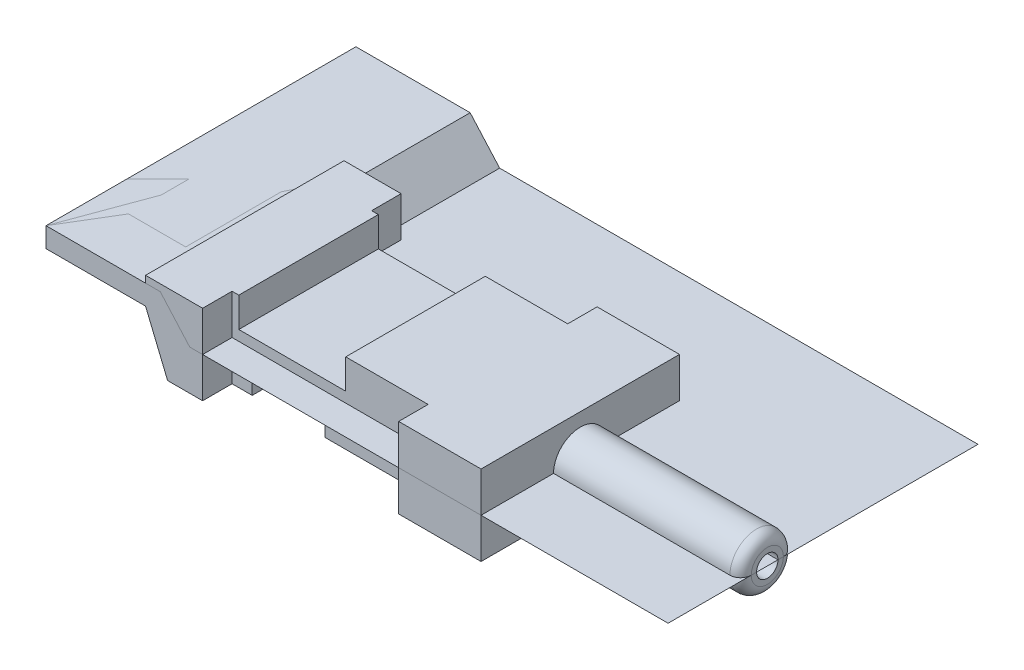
ISO-10303-21;
HEADER;
FILE_DESCRIPTION(('STEP AP214'),'2;1');
FILE_NAME('part.step','',(''),(''),'','','');
FILE_SCHEMA(('AUTOMOTIVE_DESIGN { 1 0 10303 214 1 1 1 1 }'));
ENDSEC;
DATA;
#1=APPLICATION_CONTEXT('core data for automotive mechanical design processes');
#2=APPLICATION_PROTOCOL_DEFINITION('international standard','automotive_design',2000,#1);
#3=PRODUCT_CONTEXT('',#1,'mechanical');
#4=PRODUCT('Part','Part','',(#3));
#5=PRODUCT_RELATED_PRODUCT_CATEGORY('part','',(#4));
#6=PRODUCT_DEFINITION_FORMATION('','',#4);
#7=PRODUCT_DEFINITION_CONTEXT('part definition',#1,'design');
#8=PRODUCT_DEFINITION('design','',#6,#7);
#9=PRODUCT_DEFINITION_SHAPE('','',#8);
#10=(LENGTH_UNIT() NAMED_UNIT(*) SI_UNIT(.MILLI.,.METRE.));
#11=(NAMED_UNIT(*) PLANE_ANGLE_UNIT() SI_UNIT($,.RADIAN.));
#12=(NAMED_UNIT(*) SI_UNIT($,.STERADIAN.) SOLID_ANGLE_UNIT());
#13=UNCERTAINTY_MEASURE_WITH_UNIT(LENGTH_MEASURE(1.E-05),#10,'distance_accuracy_value','');
#14=(GEOMETRIC_REPRESENTATION_CONTEXT(3) GLOBAL_UNCERTAINTY_ASSIGNED_CONTEXT((#13)) GLOBAL_UNIT_ASSIGNED_CONTEXT((#10,
#11,#12)) REPRESENTATION_CONTEXT('',''));
#15=CARTESIAN_POINT('',(0.,0.,0.));
#16=DIRECTION('',(0.,0.,1.));
#17=DIRECTION('',(1.,0.,0.));
#18=AXIS2_PLACEMENT_3D('',#15,#16,#17);
#19=CARTESIAN_POINT('',(75.7086650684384,-2.5,18.5695273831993));
#20=DIRECTION('',(0.,-1.,0.));
#21=DIRECTION('',(0.,0.,-1.));
#22=AXIS2_PLACEMENT_3D('',#19,#20,#21);
#23=PLANE('',#22);
#24=DIRECTION('',(-1.,0.,0.));
#25=VECTOR('',#24,1.);
#26=CARTESIAN_POINT('',(25.2903479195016,-2.5,13.058004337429));
#27=LINE('',#26,#25);
#28=CARTESIAN_POINT('',(25.2903479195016,-2.5,13.058004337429));
#29=VERTEX_POINT('',#28);
#30=CARTESIAN_POINT('',(-11.3977082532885,-2.5,13.058004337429));
#31=VERTEX_POINT('',#30);
#32=EDGE_CURVE('E345',#29,#31,#27,.T.);
#33=ORIENTED_EDGE('',*,*,#32,.T.);
#34=DIRECTION('',(0.,0.,1.));
#35=VECTOR('',#34,1.);
#36=CARTESIAN_POINT('',(-11.3977082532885,-2.5,13.058004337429));
#37=LINE('',#36,#35);
#38=CARTESIAN_POINT('',(-11.3977082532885,-2.5,18.5695273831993));
#39=VERTEX_POINT('',#38);
#40=EDGE_CURVE('E342',#31,#39,#37,.T.);
#41=ORIENTED_EDGE('',*,*,#40,.T.);
#42=DIRECTION('',(-1.,0.,0.));
#43=VECTOR('',#42,1.);
#44=CARTESIAN_POINT('',(-40.7086650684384,-2.5,18.5695273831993));
#45=LINE('',#44,#43);
#46=CARTESIAN_POINT('',(-13.811539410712,-2.5,18.5695273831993));
#47=VERTEX_POINT('',#46);
#48=EDGE_CURVE('E321',#39,#47,#45,.T.);
#49=ORIENTED_EDGE('',*,*,#48,.T.);
#50=DIRECTION('',(0.,0.,-1.));
#51=VECTOR('',#50,1.);
#52=CARTESIAN_POINT('',(-13.811539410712,-2.5,18.5695273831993));
#53=LINE('',#52,#51);
#54=CARTESIAN_POINT('',(-13.811539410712,-2.5,-18.5695273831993));
#55=VERTEX_POINT('',#54);
#56=EDGE_CURVE('E12',#47,#55,#53,.T.);
#57=ORIENTED_EDGE('',*,*,#56,.T.);
#58=DIRECTION('',(1.,0.,0.));
#59=VECTOR('',#58,1.);
#60=CARTESIAN_POINT('',(-40.7086650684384,-2.5,-18.5695273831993));
#61=LINE('',#60,#59);
#62=CARTESIAN_POINT('',(-11.3977082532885,-2.5,-18.5695273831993));
#63=VERTEX_POINT('',#62);
#64=EDGE_CURVE('E329',#55,#63,#61,.T.);
#65=ORIENTED_EDGE('',*,*,#64,.T.);
#66=DIRECTION('',(0.,0.,1.));
#67=VECTOR('',#66,1.);
#68=CARTESIAN_POINT('',(-11.3977082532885,-2.5,-13.058004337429));
#69=LINE('',#68,#67);
#70=CARTESIAN_POINT('',(-11.3977082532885,-2.5,-13.058004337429));
#71=VERTEX_POINT('',#70);
#72=EDGE_CURVE('E357',#63,#71,#69,.T.);
#73=ORIENTED_EDGE('',*,*,#72,.T.);
#74=DIRECTION('',(1.,0.,0.));
#75=VECTOR('',#74,1.);
#76=CARTESIAN_POINT('',(25.2903479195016,-2.5,-13.0580043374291));
#77=LINE('',#76,#75);
#78=CARTESIAN_POINT('',(25.2903479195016,-2.5,-13.0580043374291));
#79=VERTEX_POINT('',#78);
#80=EDGE_CURVE('E354',#71,#79,#77,.T.);
#81=ORIENTED_EDGE('',*,*,#80,.T.);
#82=DIRECTION('',(0.,0.,-1.));
#83=VECTOR('',#82,1.);
#84=CARTESIAN_POINT('',(25.2903479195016,-2.5,-18.5695273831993));
#85=LINE('',#84,#83);
#86=CARTESIAN_POINT('',(25.2903479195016,-2.5,-18.5695273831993));
#87=VERTEX_POINT('',#86);
#88=EDGE_CURVE('E351',#79,#87,#85,.T.);
#89=ORIENTED_EDGE('',*,*,#88,.T.);
#90=DIRECTION('',(1.,0.,0.));
#91=VECTOR('',#90,1.);
#92=CARTESIAN_POINT('',(-40.7086650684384,-2.5,-18.5695273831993));
#93=LINE('',#92,#91);
#94=CARTESIAN_POINT('',(40.7086650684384,-2.5,-18.5695273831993));
#95=VERTEX_POINT('',#94);
#96=EDGE_CURVE('E336',#87,#95,#93,.T.);
#97=ORIENTED_EDGE('',*,*,#96,.T.);
#98=DIRECTION('',(0.,0.,1.));
#99=VECTOR('',#98,1.);
#100=CARTESIAN_POINT('',(40.7086650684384,-2.5,-18.5695273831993));
#101=LINE('',#100,#99);
#102=CARTESIAN_POINT('',(40.7086650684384,-2.5,-4.99999999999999));
#103=VERTEX_POINT('',#102);
#104=EDGE_CURVE('E332',#95,#103,#101,.T.);
#105=ORIENTED_EDGE('',*,*,#104,.T.);
#106=DIRECTION('',(-1.,0.,0.));
#107=VECTOR('',#106,1.);
#108=CARTESIAN_POINT('',(75.7086650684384,-2.5,-4.99999999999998));
#109=LINE('',#108,#107);
#110=CARTESIAN_POINT('',(73.7086650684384,-2.5,-4.99999999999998));
#111=VERTEX_POINT('',#110);
#112=EDGE_CURVE('E363',#103,#111,#109,.F.);
#113=ORIENTED_EDGE('',*,*,#112,.T.);
#114=CARTESIAN_POINT('',(73.7086650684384,-2.5,-2.99999999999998));
#115=DIRECTION('',(0.,-1.,0.));
#116=DIRECTION('',(0.,0.,-1.));
#117=AXIS2_PLACEMENT_3D('',#114,#115,#116);
#118=CIRCLE('',#117,2.);
#119=CARTESIAN_POINT('',(75.7086650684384,-2.5,-2.99999999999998));
#120=VERTEX_POINT('',#119);
#121=EDGE_CURVE('E314',#120,#111,#118,.F.);
#122=ORIENTED_EDGE('',*,*,#121,.F.);
#123=DIRECTION('',(0.,0.,-1.));
#124=VECTOR('',#123,1.);
#125=CARTESIAN_POINT('',(75.7086650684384,-2.5,0.));
#126=LINE('',#125,#124);
#127=CARTESIAN_POINT('',(75.7086650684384,-2.5,-1.99999999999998));
#128=VERTEX_POINT('',#127);
#129=EDGE_CURVE('E316',#128,#120,#126,.T.);
#130=ORIENTED_EDGE('',*,*,#129,.F.);
#131=DIRECTION('',(1.,0.,0.));
#132=VECTOR('',#131,1.);
#133=CARTESIAN_POINT('',(-40.7096650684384,-2.5,-2.));
#134=LINE('',#133,#132);
#135=CARTESIAN_POINT('',(37.7086650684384,-2.5,-1.99999999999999));
#136=VERTEX_POINT('',#135);
#137=EDGE_CURVE('E247',#128,#136,#134,.F.);
#138=ORIENTED_EDGE('',*,*,#137,.T.);
#139=DIRECTION('',(0.,0.,-1.));
#140=VECTOR('',#139,1.);
#141=CARTESIAN_POINT('',(37.7086650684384,-2.5,5.00000000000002));
#142=LINE('',#141,#140);
#143=CARTESIAN_POINT('',(37.7086650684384,-2.5,-4.99999999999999));
#144=VERTEX_POINT('',#143);
#145=EDGE_CURVE('E367',#136,#144,#142,.T.);
#146=ORIENTED_EDGE('',*,*,#145,.T.);
#147=DIRECTION('',(-1.,0.,0.));
#148=VECTOR('',#147,1.);
#149=CARTESIAN_POINT('',(37.7086650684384,-2.5,-4.99999999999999));
#150=LINE('',#149,#148);
#151=CARTESIAN_POINT('',(28.7663146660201,-2.5,-4.99999999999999));
#152=VERTEX_POINT('',#151);
#153=EDGE_CURVE('E370',#144,#152,#150,.T.);
#154=ORIENTED_EDGE('',*,*,#153,.T.);
#155=DIRECTION('',(0.,0.,1.));
#156=VECTOR('',#155,1.);
#157=CARTESIAN_POINT('',(28.7663146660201,-2.5,5.00000000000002));
#158=LINE('',#157,#156);
#159=CARTESIAN_POINT('',(28.7663146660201,-2.5,5.00000000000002));
#160=VERTEX_POINT('',#159);
#161=EDGE_CURVE('E373',#152,#160,#158,.T.);
#162=ORIENTED_EDGE('',*,*,#161,.T.);
#163=DIRECTION('',(1.,0.,0.));
#164=VECTOR('',#163,1.);
#165=CARTESIAN_POINT('',(37.7086650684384,-2.5,5.00000000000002));
#166=LINE('',#165,#164);
#167=CARTESIAN_POINT('',(37.7086650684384,-2.5,5.00000000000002));
#168=VERTEX_POINT('',#167);
#169=EDGE_CURVE('E254',#160,#168,#166,.T.);
#170=ORIENTED_EDGE('',*,*,#169,.T.);
#171=CARTESIAN_POINT('',(37.7086650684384,-2.5,2.00000000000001));
#172=VERTEX_POINT('',#171);
#173=EDGE_CURVE('E366',#168,#172,#142,.T.);
#174=ORIENTED_EDGE('',*,*,#173,.T.);
#175=DIRECTION('',(1.,0.,0.));
#176=VECTOR('',#175,1.);
#177=CARTESIAN_POINT('',(-40.7096650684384,-2.5,2.));
#178=LINE('',#177,#176);
#179=CARTESIAN_POINT('',(75.7086650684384,-2.5,2.00000000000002));
#180=VERTEX_POINT('',#179);
#181=EDGE_CURVE('E245',#172,#180,#178,.T.);
#182=ORIENTED_EDGE('',*,*,#181,.T.);
#183=CARTESIAN_POINT('',(75.7086650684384,-2.5,3.00000000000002));
#184=VERTEX_POINT('',#183);
#185=EDGE_CURVE('E239',#184,#180,#126,.T.);
#186=ORIENTED_EDGE('',*,*,#185,.F.);
#187=CARTESIAN_POINT('',(73.7086650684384,-2.5,3.00000000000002));
#188=DIRECTION('',(0.,-1.,0.));
#189=DIRECTION('',(0.,0.,-1.));
#190=AXIS2_PLACEMENT_3D('',#187,#188,#189);
#191=CIRCLE('',#190,2.);
#192=CARTESIAN_POINT('',(73.7086650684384,-2.5,5.00000000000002));
#193=VERTEX_POINT('',#192);
#194=EDGE_CURVE('E262',#193,#184,#191,.F.);
#195=ORIENTED_EDGE('',*,*,#194,.F.);
#196=DIRECTION('',(-1.,0.,0.));
#197=VECTOR('',#196,1.);
#198=CARTESIAN_POINT('',(75.7086650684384,-2.5,5.00000000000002));
#199=LINE('',#198,#197);
#200=CARTESIAN_POINT('',(40.7086650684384,-2.5,5.00000000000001));
#201=VERTEX_POINT('',#200);
#202=EDGE_CURVE('E360',#193,#201,#199,.T.);
#203=ORIENTED_EDGE('',*,*,#202,.T.);
#204=CARTESIAN_POINT('',(40.7086650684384,-2.5,18.5695273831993));
#205=VERTEX_POINT('',#204);
#206=EDGE_CURVE('E333',#201,#205,#101,.T.);
#207=ORIENTED_EDGE('',*,*,#206,.T.);
#208=DIRECTION('',(-1.,0.,0.));
#209=VECTOR('',#208,1.);
#210=CARTESIAN_POINT('',(-40.7086650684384,-2.5,18.5695273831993));
#211=LINE('',#210,#209);
#212=CARTESIAN_POINT('',(25.2903479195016,-2.5,18.5695273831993));
#213=VERTEX_POINT('',#212);
#214=EDGE_CURVE('E339',#205,#213,#211,.T.);
#215=ORIENTED_EDGE('',*,*,#214,.T.);
#216=DIRECTION('',(0.,0.,-1.));
#217=VECTOR('',#216,1.);
#218=CARTESIAN_POINT('',(25.2903479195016,-2.5,18.5695273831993));
#219=LINE('',#218,#217);
#220=EDGE_CURVE('E348',#213,#29,#219,.T.);
#221=ORIENTED_EDGE('',*,*,#220,.T.);
#222=EDGE_LOOP('',(#33,#41,#49,#57,#65,#73,#81,#89,#97,#105,#113,#122,#130,#138,#146,#154,#162,
#170,#174,#182,#186,#195,#203,#207,#215,#221));
#223=FACE_BOUND('',#222,.T.);
#224=ADVANCED_FACE('F44',(#223),#23,.T.);
#225=CARTESIAN_POINT('',(-40.7086650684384,3.7238100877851,18.5695273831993));
#226=DIRECTION('',(0.,-1.,0.));
#227=DIRECTION('',(0.,0.,-1.));
#228=AXIS2_PLACEMENT_3D('',#225,#226,#227);
#229=PLANE('',#228);
#230=DIRECTION('',(0.,0.,-1.));
#231=VECTOR('',#230,1.);
#232=CARTESIAN_POINT('',(-22.0774506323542,3.7238100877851,18.5695273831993));
#233=LINE('',#232,#231);
#234=CARTESIAN_POINT('',(-22.0774506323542,3.7238100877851,18.5695273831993));
#235=VERTEX_POINT('',#234);
#236=CARTESIAN_POINT('',(-22.0774506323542,3.7238100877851,-18.5695273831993));
#237=VERTEX_POINT('',#236);
#238=EDGE_CURVE('E48',#235,#237,#233,.T.);
#239=ORIENTED_EDGE('',*,*,#238,.T.);
#240=DIRECTION('',(1.,0.,0.));
#241=VECTOR('',#240,1.);
#242=CARTESIAN_POINT('',(-40.7086650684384,3.7238100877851,-18.5695273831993));
#243=LINE('',#242,#241);
#244=CARTESIAN_POINT('',(-19.3295566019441,3.7238100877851,-18.5695273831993));
#245=VERTEX_POINT('',#244);
#246=EDGE_CURVE('E324',#237,#245,#243,.T.);
#247=ORIENTED_EDGE('',*,*,#246,.T.);
#248=DIRECTION('',(0.,0.,-1.));
#249=VECTOR('',#248,1.);
#250=CARTESIAN_POINT('',(-19.3295566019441,3.7238100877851,18.5695273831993));
#251=LINE('',#250,#249);
#252=CARTESIAN_POINT('',(-19.3295566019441,3.7238100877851,18.5695273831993));
#253=VERTEX_POINT('',#252);
#254=EDGE_CURVE('E53',#253,#245,#251,.T.);
#255=ORIENTED_EDGE('',*,*,#254,.F.);
#256=DIRECTION('',(-1.,0.,0.));
#257=VECTOR('',#256,1.);
#258=CARTESIAN_POINT('',(-40.7086650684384,3.7238100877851,18.5695273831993));
#259=LINE('',#258,#257);
#260=EDGE_CURVE('E229',#253,#235,#259,.T.);
#261=ORIENTED_EDGE('',*,*,#260,.T.);
#262=EDGE_LOOP('',(#239,#247,#255,#261));
#263=FACE_BOUND('',#262,.T.);
#264=ADVANCED_FACE('F236',(#263),#229,.T.);
#265=CARTESIAN_POINT('',(-13.811539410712,-2.5,18.5695273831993));
#266=DIRECTION('',(-0.748259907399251,-0.663405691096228,0.));
#267=DIRECTION('',(0.663405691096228,-0.748259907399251,0.));
#268=AXIS2_PLACEMENT_3D('',#265,#266,#267);
#269=PLANE('',#268);
#270=ORIENTED_EDGE('',*,*,#254,.T.);
#271=DIRECTION('',(0.663405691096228,-0.748259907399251,0.));
#272=VECTOR('',#271,1.);
#273=CARTESIAN_POINT('',(-29.372154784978,15.0509266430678,-18.5695273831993));
#274=LINE('',#273,#272);
#275=EDGE_CURVE('E326',#245,#55,#274,.T.);
#276=ORIENTED_EDGE('',*,*,#275,.T.);
#277=ORIENTED_EDGE('',*,*,#56,.F.);
#278=DIRECTION('',(-0.663405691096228,0.748259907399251,0.));
#279=VECTOR('',#278,1.);
#280=CARTESIAN_POINT('',(-29.372154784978,15.0509266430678,18.5695273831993));
#281=LINE('',#280,#279);
#282=EDGE_CURVE('E240',#47,#253,#281,.T.);
#283=ORIENTED_EDGE('',*,*,#282,.T.);
#284=EDGE_LOOP('',(#270,#276,#277,#283));
#285=FACE_BOUND('',#284,.T.);
#286=ADVANCED_FACE('F473',(#285),#269,.T.);
#287=CARTESIAN_POINT('',(-40.7086650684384,5.,18.5695273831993));
#288=DIRECTION('',(0.,0.,-1.));
#289=DIRECTION('',(-1.,0.,0.));
#290=AXIS2_PLACEMENT_3D('',#287,#288,#289);
#291=PLANE('',#290);
#292=ORIENTED_EDGE('',*,*,#260,.F.);
#293=ORIENTED_EDGE('',*,*,#282,.F.);
#294=ORIENTED_EDGE('',*,*,#48,.F.);
#295=DIRECTION('',(0.,1.,0.));
#296=VECTOR('',#295,1.);
#297=CARTESIAN_POINT('',(-11.3977082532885,-10.001,18.5695273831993));
#298=LINE('',#297,#296);
#299=CARTESIAN_POINT('',(-11.3977082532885,5.,18.5695273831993));
#300=VERTEX_POINT('',#299);
#301=EDGE_CURVE('E272',#39,#300,#298,.T.);
#302=ORIENTED_EDGE('',*,*,#301,.T.);
#303=DIRECTION('',(1.,0.,0.));
#304=VECTOR('',#303,1.);
#305=CARTESIAN_POINT('',(-40.7086650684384,5.,18.5695273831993));
#306=LINE('',#305,#304);
#307=CARTESIAN_POINT('',(-22.0774506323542,5.,18.5695273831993));
#308=VERTEX_POINT('',#307);
#309=EDGE_CURVE('E231',#308,#300,#306,.T.);
#310=ORIENTED_EDGE('',*,*,#309,.F.);
#311=DIRECTION('',(0.,1.,0.));
#312=VECTOR('',#311,1.);
#313=CARTESIAN_POINT('',(-22.0774506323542,3.7238100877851,18.5695273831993));
#314=LINE('',#313,#312);
#315=EDGE_CURVE('E225',#235,#308,#314,.T.);
#316=ORIENTED_EDGE('',*,*,#315,.F.);
#317=EDGE_LOOP('',(#292,#293,#294,#302,#310,#316));
#318=FACE_BOUND('',#317,.T.);
#319=ADVANCED_FACE('F227',(#318),#291,.F.);
#320=CARTESIAN_POINT('',(-40.7086650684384,5.,-18.5695273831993));
#321=DIRECTION('',(0.,0.,1.));
#322=DIRECTION('',(1.,0.,0.));
#323=AXIS2_PLACEMENT_3D('',#320,#321,#322);
#324=PLANE('',#323);
#325=ORIENTED_EDGE('',*,*,#246,.F.);
#326=DIRECTION('',(0.,-1.,0.));
#327=VECTOR('',#326,1.);
#328=CARTESIAN_POINT('',(-22.0774506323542,5.00000000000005,-18.5695273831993));
#329=LINE('',#328,#327);
#330=CARTESIAN_POINT('',(-22.0774506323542,5.,-18.5695273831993));
#331=VERTEX_POINT('',#330);
#332=EDGE_CURVE('E243',#331,#237,#329,.T.);
#333=ORIENTED_EDGE('',*,*,#332,.F.);
#334=DIRECTION('',(-1.,0.,0.));
#335=VECTOR('',#334,1.);
#336=CARTESIAN_POINT('',(-40.7086650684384,5.,-18.5695273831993));
#337=LINE('',#336,#335);
#338=CARTESIAN_POINT('',(-11.3977082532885,5.,-18.5695273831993));
#339=VERTEX_POINT('',#338);
#340=EDGE_CURVE('E738',#339,#331,#337,.T.);
#341=ORIENTED_EDGE('',*,*,#340,.F.);
#342=DIRECTION('',(0.,1.,0.));
#343=VECTOR('',#342,1.);
#344=CARTESIAN_POINT('',(-11.3977082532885,-10.001,-18.5695273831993));
#345=LINE('',#344,#343);
#346=EDGE_CURVE('E289',#63,#339,#345,.T.);
#347=ORIENTED_EDGE('',*,*,#346,.F.);
#348=ORIENTED_EDGE('',*,*,#64,.F.);
#349=ORIENTED_EDGE('',*,*,#275,.F.);
#350=EDGE_LOOP('',(#325,#333,#341,#347,#348,#349));
#351=FACE_BOUND('',#350,.T.);
#352=ADVANCED_FACE('F472',(#351),#324,.F.);
#353=CARTESIAN_POINT('',(40.7086650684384,5.,-18.5695273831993));
#354=DIRECTION('',(-1.,0.,0.));
#355=DIRECTION('',(0.,0.,1.));
#356=AXIS2_PLACEMENT_3D('',#353,#354,#355);
#357=PLANE('',#356);
#358=ORIENTED_EDGE('',*,*,#104,.F.);
#359=DIRECTION('',(0.,-1.,0.));
#360=VECTOR('',#359,1.);
#361=CARTESIAN_POINT('',(40.7086650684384,5.,-18.5695273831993));
#362=LINE('',#361,#360);
#363=CARTESIAN_POINT('',(40.7086650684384,5.,-18.5695273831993));
#364=VERTEX_POINT('',#363);
#365=EDGE_CURVE('E269',#364,#95,#362,.T.);
#366=ORIENTED_EDGE('',*,*,#365,.F.);
#367=DIRECTION('',(0.,0.,-1.));
#368=VECTOR('',#367,1.);
#369=CARTESIAN_POINT('',(40.7086650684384,5.,-18.5695273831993));
#370=LINE('',#369,#368);
#371=CARTESIAN_POINT('',(40.7086650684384,5.,18.5695273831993));
#372=VERTEX_POINT('',#371);
#373=EDGE_CURVE('E736',#372,#364,#370,.T.);
#374=ORIENTED_EDGE('',*,*,#373,.F.);
#375=DIRECTION('',(0.,-1.,0.));
#376=VECTOR('',#375,1.);
#377=CARTESIAN_POINT('',(40.7086650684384,5.,18.5695273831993));
#378=LINE('',#377,#376);
#379=EDGE_CURVE('E267',#372,#205,#378,.T.);
#380=ORIENTED_EDGE('',*,*,#379,.T.);
#381=ORIENTED_EDGE('',*,*,#206,.F.);
#382=CARTESIAN_POINT('',(40.7086650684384,-2.5,0.));
#383=DIRECTION('',(-1.,0.,0.));
#384=DIRECTION('',(0.,0.,1.));
#385=AXIS2_PLACEMENT_3D('',#382,#383,#384);
#386=CIRCLE('',#385,5.);
#387=EDGE_CURVE('E265',#103,#201,#386,.F.);
#388=ORIENTED_EDGE('',*,*,#387,.F.);
#389=EDGE_LOOP('',(#358,#366,#374,#380,#381,#388));
#390=FACE_BOUND('',#389,.T.);
#391=ADVANCED_FACE('F408',(#390),#357,.F.);
#392=ORIENTED_EDGE('',*,*,#96,.F.);
#393=DIRECTION('',(0.,1.,0.));
#394=VECTOR('',#393,1.);
#395=CARTESIAN_POINT('',(25.2903479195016,-10.001,-18.5695273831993));
#396=LINE('',#395,#394);
#397=CARTESIAN_POINT('',(25.2903479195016,5.,-18.5695273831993));
#398=VERTEX_POINT('',#397);
#399=EDGE_CURVE('E282',#87,#398,#396,.T.);
#400=ORIENTED_EDGE('',*,*,#399,.T.);
#401=EDGE_CURVE('E271',#364,#398,#337,.T.);
#402=ORIENTED_EDGE('',*,*,#401,.F.);
#403=ORIENTED_EDGE('',*,*,#365,.T.);
#404=EDGE_LOOP('',(#392,#400,#402,#403));
#405=FACE_BOUND('',#404,.T.);
#406=ADVANCED_FACE('F481',(#405),#324,.F.);
#407=ORIENTED_EDGE('',*,*,#214,.F.);
#408=ORIENTED_EDGE('',*,*,#379,.F.);
#409=CARTESIAN_POINT('',(25.2903479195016,5.,18.5695273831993));
#410=VERTEX_POINT('',#409);
#411=EDGE_CURVE('E416',#410,#372,#306,.T.);
#412=ORIENTED_EDGE('',*,*,#411,.F.);
#413=DIRECTION('',(0.,1.,0.));
#414=VECTOR('',#413,1.);
#415=CARTESIAN_POINT('',(25.2903479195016,-10.001,18.5695273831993));
#416=LINE('',#415,#414);
#417=EDGE_CURVE('E279',#213,#410,#416,.T.);
#418=ORIENTED_EDGE('',*,*,#417,.F.);
#419=EDGE_LOOP('',(#407,#408,#412,#418));
#420=FACE_BOUND('',#419,.T.);
#421=ADVANCED_FACE('F414',(#420),#291,.F.);
#422=CARTESIAN_POINT('',(-11.3977082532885,-10.001,13.058004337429));
#423=DIRECTION('',(-1.,0.,0.));
#424=DIRECTION('',(0.,0.,1.));
#425=AXIS2_PLACEMENT_3D('',#422,#423,#424);
#426=PLANE('',#425);
#427=ORIENTED_EDGE('',*,*,#40,.F.);
#428=DIRECTION('',(0.,1.,0.));
#429=VECTOR('',#428,1.);
#430=CARTESIAN_POINT('',(-11.3977082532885,-10.001,13.058004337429));
#431=LINE('',#430,#429);
#432=CARTESIAN_POINT('',(-11.3977082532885,5.,13.058004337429));
#433=VERTEX_POINT('',#432);
#434=EDGE_CURVE('E274',#31,#433,#431,.T.);
#435=ORIENTED_EDGE('',*,*,#434,.T.);
#436=DIRECTION('',(0.,0.,1.));
#437=VECTOR('',#436,1.);
#438=CARTESIAN_POINT('',(-11.3977082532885,5.,13.058004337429));
#439=LINE('',#438,#437);
#440=EDGE_CURVE('E281',#433,#300,#439,.T.);
#441=ORIENTED_EDGE('',*,*,#440,.T.);
#442=ORIENTED_EDGE('',*,*,#301,.F.);
#443=EDGE_LOOP('',(#427,#435,#441,#442));
#444=FACE_BOUND('',#443,.T.);
#445=ADVANCED_FACE('F486',(#444),#426,.F.);
#446=CARTESIAN_POINT('',(25.2903479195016,-10.001,13.058004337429));
#447=DIRECTION('',(0.,0.,-1.));
#448=DIRECTION('',(-1.,0.,0.));
#449=AXIS2_PLACEMENT_3D('',#446,#447,#448);
#450=PLANE('',#449);
#451=ORIENTED_EDGE('',*,*,#32,.F.);
#452=DIRECTION('',(0.,1.,0.));
#453=VECTOR('',#452,1.);
#454=CARTESIAN_POINT('',(25.2903479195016,-10.001,13.058004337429));
#455=LINE('',#454,#453);
#456=CARTESIAN_POINT('',(25.2903479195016,5.,13.058004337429));
#457=VERTEX_POINT('',#456);
#458=EDGE_CURVE('E277',#29,#457,#455,.T.);
#459=ORIENTED_EDGE('',*,*,#458,.T.);
#460=DIRECTION('',(-1.,0.,0.));
#461=VECTOR('',#460,1.);
#462=CARTESIAN_POINT('',(25.2903479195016,5.,13.058004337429));
#463=LINE('',#462,#461);
#464=CARTESIAN_POINT('',(9.87203077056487,5.,13.058004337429));
#465=VERTEX_POINT('',#464);
#466=EDGE_CURVE('E426',#457,#465,#463,.T.);
#467=ORIENTED_EDGE('',*,*,#466,.T.);
#468=DIRECTION('',(0.,-1.,0.));
#469=VECTOR('',#468,1.);
#470=CARTESIAN_POINT('',(9.87203077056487,-10.001,13.058004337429));
#471=LINE('',#470,#469);
#472=CARTESIAN_POINT('',(9.87203077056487,-0.570466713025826,13.058004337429));
#473=VERTEX_POINT('',#472);
#474=EDGE_CURVE('E427',#465,#473,#471,.T.);
#475=ORIENTED_EDGE('',*,*,#474,.T.);
#476=DIRECTION('',(-1.,0.,0.));
#477=VECTOR('',#476,1.);
#478=CARTESIAN_POINT('',(25.2903479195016,-0.570466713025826,13.058004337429));
#479=LINE('',#478,#477);
#480=CARTESIAN_POINT('',(-10.1412679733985,-0.570466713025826,13.058004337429));
#481=VERTEX_POINT('',#480);
#482=EDGE_CURVE('E275',#473,#481,#479,.T.);
#483=ORIENTED_EDGE('',*,*,#482,.T.);
#484=DIRECTION('',(0.,1.,0.));
#485=VECTOR('',#484,1.);
#486=CARTESIAN_POINT('',(-10.1412679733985,-10.001,13.058004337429));
#487=LINE('',#486,#485);
#488=CARTESIAN_POINT('',(-10.1412679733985,5.,13.058004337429));
#489=VERTEX_POINT('',#488);
#490=EDGE_CURVE('E431',#481,#489,#487,.T.);
#491=ORIENTED_EDGE('',*,*,#490,.T.);
#492=EDGE_CURVE('E428',#489,#433,#463,.T.);
#493=ORIENTED_EDGE('',*,*,#492,.T.);
#494=ORIENTED_EDGE('',*,*,#434,.F.);
#495=EDGE_LOOP('',(#451,#459,#467,#475,#483,#491,#493,#494));
#496=FACE_BOUND('',#495,.T.);
#497=ADVANCED_FACE('F491',(#496),#450,.F.);
#498=CARTESIAN_POINT('',(25.2903479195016,-10.001,18.5695273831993));
#499=DIRECTION('',(1.,0.,0.));
#500=DIRECTION('',(0.,0.,-1.));
#501=AXIS2_PLACEMENT_3D('',#498,#499,#500);
#502=PLANE('',#501);
#503=ORIENTED_EDGE('',*,*,#220,.F.);
#504=ORIENTED_EDGE('',*,*,#417,.T.);
#505=DIRECTION('',(0.,0.,-1.));
#506=VECTOR('',#505,1.);
#507=CARTESIAN_POINT('',(25.2903479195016,5.,18.5695273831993));
#508=LINE('',#507,#506);
#509=EDGE_CURVE('E420',#410,#457,#508,.T.);
#510=ORIENTED_EDGE('',*,*,#509,.T.);
#511=ORIENTED_EDGE('',*,*,#458,.F.);
#512=EDGE_LOOP('',(#503,#504,#510,#511));
#513=FACE_BOUND('',#512,.T.);
#514=ADVANCED_FACE('F46',(#513),#502,.F.);
#515=CARTESIAN_POINT('',(25.2903479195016,-10.001,-18.5695273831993));
#516=DIRECTION('',(1.,0.,0.));
#517=DIRECTION('',(0.,0.,-1.));
#518=AXIS2_PLACEMENT_3D('',#515,#516,#517);
#519=PLANE('',#518);
#520=ORIENTED_EDGE('',*,*,#88,.F.);
#521=DIRECTION('',(0.,1.,0.));
#522=VECTOR('',#521,1.);
#523=CARTESIAN_POINT('',(25.2903479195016,-10.001,-13.0580043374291));
#524=LINE('',#523,#522);
#525=CARTESIAN_POINT('',(25.2903479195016,5.,-13.0580043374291));
#526=VERTEX_POINT('',#525);
#527=EDGE_CURVE('E284',#79,#526,#524,.T.);
#528=ORIENTED_EDGE('',*,*,#527,.T.);
#529=DIRECTION('',(0.,0.,-1.));
#530=VECTOR('',#529,1.);
#531=CARTESIAN_POINT('',(25.2903479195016,5.,-18.5695273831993));
#532=LINE('',#531,#530);
#533=EDGE_CURVE('E291',#526,#398,#532,.T.);
#534=ORIENTED_EDGE('',*,*,#533,.T.);
#535=ORIENTED_EDGE('',*,*,#399,.F.);
#536=EDGE_LOOP('',(#520,#528,#534,#535));
#537=FACE_BOUND('',#536,.T.);
#538=ADVANCED_FACE('F635',(#537),#519,.F.);
#539=CARTESIAN_POINT('',(25.2903479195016,-10.001,-13.0580043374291));
#540=DIRECTION('',(0.,0.,1.));
#541=DIRECTION('',(1.,0.,0.));
#542=AXIS2_PLACEMENT_3D('',#539,#540,#541);
#543=PLANE('',#542);
#544=ORIENTED_EDGE('',*,*,#80,.F.);
#545=DIRECTION('',(0.,1.,0.));
#546=VECTOR('',#545,1.);
#547=CARTESIAN_POINT('',(-11.3977082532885,-10.001,-13.058004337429));
#548=LINE('',#547,#546);
#549=CARTESIAN_POINT('',(-11.3977082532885,5.,-13.058004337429));
#550=VERTEX_POINT('',#549);
#551=EDGE_CURVE('E287',#71,#550,#548,.T.);
#552=ORIENTED_EDGE('',*,*,#551,.T.);
#553=DIRECTION('',(1.,0.,0.));
#554=VECTOR('',#553,1.);
#555=CARTESIAN_POINT('',(25.2903479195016,5.,-13.0580043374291));
#556=LINE('',#555,#554);
#557=CARTESIAN_POINT('',(-10.1412679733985,5.,-13.058004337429));
#558=VERTEX_POINT('',#557);
#559=EDGE_CURVE('E442',#550,#558,#556,.T.);
#560=ORIENTED_EDGE('',*,*,#559,.T.);
#561=DIRECTION('',(0.,-1.,0.));
#562=VECTOR('',#561,1.);
#563=CARTESIAN_POINT('',(-10.1412679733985,-10.001,-13.058004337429));
#564=LINE('',#563,#562);
#565=CARTESIAN_POINT('',(-10.1412679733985,-0.570466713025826,-13.058004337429));
#566=VERTEX_POINT('',#565);
#567=EDGE_CURVE('E295',#558,#566,#564,.T.);
#568=ORIENTED_EDGE('',*,*,#567,.T.);
#569=DIRECTION('',(1.,0.,0.));
#570=VECTOR('',#569,1.);
#571=CARTESIAN_POINT('',(25.2903479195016,-0.570466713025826,-13.0580043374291));
#572=LINE('',#571,#570);
#573=CARTESIAN_POINT('',(9.87203077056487,-0.570466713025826,-13.0580043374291));
#574=VERTEX_POINT('',#573);
#575=EDGE_CURVE('E285',#566,#574,#572,.T.);
#576=ORIENTED_EDGE('',*,*,#575,.T.);
#577=DIRECTION('',(0.,1.,0.));
#578=VECTOR('',#577,1.);
#579=CARTESIAN_POINT('',(9.87203077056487,-10.001,-13.0580043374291));
#580=LINE('',#579,#578);
#581=CARTESIAN_POINT('',(9.87203077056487,5.,-13.0580043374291));
#582=VERTEX_POINT('',#581);
#583=EDGE_CURVE('E448',#574,#582,#580,.T.);
#584=ORIENTED_EDGE('',*,*,#583,.T.);
#585=EDGE_CURVE('E444',#582,#526,#556,.T.);
#586=ORIENTED_EDGE('',*,*,#585,.T.);
#587=ORIENTED_EDGE('',*,*,#527,.F.);
#588=EDGE_LOOP('',(#544,#552,#560,#568,#576,#584,#586,#587));
#589=FACE_BOUND('',#588,.T.);
#590=ADVANCED_FACE('F643',(#589),#543,.F.);
#591=CARTESIAN_POINT('',(-11.3977082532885,-10.001,-13.058004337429));
#592=DIRECTION('',(-1.,0.,0.));
#593=DIRECTION('',(0.,0.,1.));
#594=AXIS2_PLACEMENT_3D('',#591,#592,#593);
#595=PLANE('',#594);
#596=ORIENTED_EDGE('',*,*,#72,.F.);
#597=ORIENTED_EDGE('',*,*,#346,.T.);
#598=DIRECTION('',(0.,0.,1.));
#599=VECTOR('',#598,1.);
#600=CARTESIAN_POINT('',(-11.3977082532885,5.,-13.058004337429));
#601=LINE('',#600,#599);
#602=EDGE_CURVE('E445',#339,#550,#601,.T.);
#603=ORIENTED_EDGE('',*,*,#602,.T.);
#604=ORIENTED_EDGE('',*,*,#551,.F.);
#605=EDGE_LOOP('',(#596,#597,#603,#604));
#606=FACE_BOUND('',#605,.T.);
#607=ADVANCED_FACE('F505',(#606),#595,.F.);
#608=CARTESIAN_POINT('',(75.7086650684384,-2.5,0.));
#609=DIRECTION('',(-1.,0.,0.));
#610=DIRECTION('',(0.,0.,1.));
#611=AXIS2_PLACEMENT_3D('',#608,#609,#610);
#612=CYLINDRICAL_SURFACE('',#611,5.);
#613=ORIENTED_EDGE('',*,*,#202,.F.);
#614=CARTESIAN_POINT('',(73.7086650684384,-2.5,0.));
#615=DIRECTION('',(1.,0.,0.));
#616=DIRECTION('',(0.,0.,-1.));
#617=AXIS2_PLACEMENT_3D('',#614,#615,#616);
#618=CIRCLE('',#617,5.);
#619=EDGE_CURVE('E258',#193,#111,#618,.F.);
#620=ORIENTED_EDGE('',*,*,#619,.T.);
#621=ORIENTED_EDGE('',*,*,#112,.F.);
#622=ORIENTED_EDGE('',*,*,#387,.T.);
#623=EDGE_LOOP('',(#613,#620,#621,#622));
#624=FACE_BOUND('',#623,.T.);
#625=ADVANCED_FACE('F402',(#624),#612,.T.);
#626=CARTESIAN_POINT('',(75.7086650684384,-2.5,0.));
#627=DIRECTION('',(1.,0.,0.));
#628=DIRECTION('',(0.,0.,-1.));
#629=AXIS2_PLACEMENT_3D('',#626,#627,#628);
#630=PLANE('',#629);
#631=CARTESIAN_POINT('',(75.7086650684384,-2.5,0.));
#632=DIRECTION('',(1.,0.,0.));
#633=DIRECTION('',(0.,0.,-1.));
#634=AXIS2_PLACEMENT_3D('',#631,#632,#633);
#635=CIRCLE('',#634,3.);
#636=EDGE_CURVE('E261',#120,#184,#635,.T.);
#637=ORIENTED_EDGE('',*,*,#636,.T.);
#638=ORIENTED_EDGE('',*,*,#185,.T.);
#639=CARTESIAN_POINT('',(75.7086650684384,-2.5,0.));
#640=DIRECTION('',(1.,0.,0.));
#641=DIRECTION('',(0.,0.,-1.));
#642=AXIS2_PLACEMENT_3D('',#639,#640,#641);
#643=CIRCLE('',#642,2.);
#644=EDGE_CURVE('E302',#128,#180,#643,.T.);
#645=ORIENTED_EDGE('',*,*,#644,.F.);
#646=ORIENTED_EDGE('',*,*,#129,.T.);
#647=EDGE_LOOP('',(#637,#638,#645,#646));
#648=FACE_BOUND('',#647,.T.);
#649=ADVANCED_FACE('F391',(#648),#630,.T.);
#650=CARTESIAN_POINT('',(37.7086650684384,0.,5.00000000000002));
#651=DIRECTION('',(1.,0.,0.));
#652=DIRECTION('',(0.,0.,-1.));
#653=AXIS2_PLACEMENT_3D('',#650,#651,#652);
#654=PLANE('',#653);
#655=ORIENTED_EDGE('',*,*,#173,.F.);
#656=DIRECTION('',(0.,-1.,0.));
#657=VECTOR('',#656,1.);
#658=CARTESIAN_POINT('',(37.7086650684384,0.,5.00000000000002));
#659=LINE('',#658,#657);
#660=CARTESIAN_POINT('',(37.7086650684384,0.,5.00000000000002));
#661=VERTEX_POINT('',#660);
#662=EDGE_CURVE('E69',#661,#168,#659,.T.);
#663=ORIENTED_EDGE('',*,*,#662,.F.);
#664=DIRECTION('',(0.,0.,1.));
#665=VECTOR('',#664,1.);
#666=CARTESIAN_POINT('',(37.7086650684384,0.,5.00000000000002));
#667=LINE('',#666,#665);
#668=CARTESIAN_POINT('',(37.7086650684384,0.,-4.99999999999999));
#669=VERTEX_POINT('',#668);
#670=EDGE_CURVE('E303',#669,#661,#667,.T.);
#671=ORIENTED_EDGE('',*,*,#670,.F.);
#672=DIRECTION('',(0.,-1.,0.));
#673=VECTOR('',#672,1.);
#674=CARTESIAN_POINT('',(37.7086650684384,0.,-4.99999999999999));
#675=LINE('',#674,#673);
#676=EDGE_CURVE('E292',#669,#144,#675,.T.);
#677=ORIENTED_EDGE('',*,*,#676,.T.);
#678=ORIENTED_EDGE('',*,*,#145,.F.);
#679=CARTESIAN_POINT('',(37.7086650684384,-2.5,0.));
#680=DIRECTION('',(1.,0.,0.));
#681=DIRECTION('',(0.,0.,-1.));
#682=AXIS2_PLACEMENT_3D('',#679,#680,#681);
#683=CIRCLE('',#682,2.);
#684=EDGE_CURVE('E301',#172,#136,#683,.F.);
#685=ORIENTED_EDGE('',*,*,#684,.F.);
#686=EDGE_LOOP('',(#655,#663,#671,#677,#678,#685));
#687=FACE_BOUND('',#686,.T.);
#688=ADVANCED_FACE('F384',(#687),#654,.F.);
#689=CARTESIAN_POINT('',(37.7086650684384,0.,-4.99999999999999));
#690=DIRECTION('',(0.,0.,-1.));
#691=DIRECTION('',(-1.,0.,0.));
#692=AXIS2_PLACEMENT_3D('',#689,#690,#691);
#693=PLANE('',#692);
#694=ORIENTED_EDGE('',*,*,#153,.F.);
#695=ORIENTED_EDGE('',*,*,#676,.F.);
#696=DIRECTION('',(1.,0.,0.));
#697=VECTOR('',#696,1.);
#698=CARTESIAN_POINT('',(37.7086650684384,0.,-4.99999999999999));
#699=LINE('',#698,#697);
#700=CARTESIAN_POINT('',(28.7663146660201,0.,-4.99999999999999));
#701=VERTEX_POINT('',#700);
#702=EDGE_CURVE('E300',#701,#669,#699,.T.);
#703=ORIENTED_EDGE('',*,*,#702,.F.);
#704=DIRECTION('',(0.,-1.,0.));
#705=VECTOR('',#704,1.);
#706=CARTESIAN_POINT('',(28.7663146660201,0.,-4.99999999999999));
#707=LINE('',#706,#705);
#708=EDGE_CURVE('E294',#701,#152,#707,.T.);
#709=ORIENTED_EDGE('',*,*,#708,.T.);
#710=EDGE_LOOP('',(#694,#695,#703,#709));
#711=FACE_BOUND('',#710,.T.);
#712=ADVANCED_FACE('F459',(#711),#693,.F.);
#713=CARTESIAN_POINT('',(28.7663146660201,0.,5.00000000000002));
#714=DIRECTION('',(-1.,0.,0.));
#715=DIRECTION('',(0.,0.,1.));
#716=AXIS2_PLACEMENT_3D('',#713,#714,#715);
#717=PLANE('',#716);
#718=ORIENTED_EDGE('',*,*,#161,.F.);
#719=ORIENTED_EDGE('',*,*,#708,.F.);
#720=DIRECTION('',(0.,0.,-1.));
#721=VECTOR('',#720,1.);
#722=CARTESIAN_POINT('',(28.7663146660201,0.,5.00000000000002));
#723=LINE('',#722,#721);
#724=CARTESIAN_POINT('',(28.7663146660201,0.,5.00000000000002));
#725=VERTEX_POINT('',#724);
#726=EDGE_CURVE('E453',#725,#701,#723,.T.);
#727=ORIENTED_EDGE('',*,*,#726,.F.);
#728=DIRECTION('',(0.,-1.,0.));
#729=VECTOR('',#728,1.);
#730=CARTESIAN_POINT('',(28.7663146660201,0.,5.00000000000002));
#731=LINE('',#730,#729);
#732=EDGE_CURVE('E297',#725,#160,#731,.T.);
#733=ORIENTED_EDGE('',*,*,#732,.T.);
#734=EDGE_LOOP('',(#718,#719,#727,#733));
#735=FACE_BOUND('',#734,.T.);
#736=ADVANCED_FACE('F461',(#735),#717,.F.);
#737=CARTESIAN_POINT('',(37.7086650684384,0.,5.00000000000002));
#738=DIRECTION('',(0.,0.,1.));
#739=DIRECTION('',(1.,0.,0.));
#740=AXIS2_PLACEMENT_3D('',#737,#738,#739);
#741=PLANE('',#740);
#742=ORIENTED_EDGE('',*,*,#169,.F.);
#743=ORIENTED_EDGE('',*,*,#732,.F.);
#744=DIRECTION('',(-1.,0.,0.));
#745=VECTOR('',#744,1.);
#746=CARTESIAN_POINT('',(37.7086650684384,0.,5.00000000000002));
#747=LINE('',#746,#745);
#748=EDGE_CURVE('E382',#661,#725,#747,.T.);
#749=ORIENTED_EDGE('',*,*,#748,.F.);
#750=ORIENTED_EDGE('',*,*,#662,.T.);
#751=EDGE_LOOP('',(#742,#743,#749,#750));
#752=FACE_BOUND('',#751,.T.);
#753=ADVANCED_FACE('F379',(#752),#741,.F.);
#754=CARTESIAN_POINT('',(-40.7096650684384,-2.5,0.));
#755=DIRECTION('',(1.,0.,0.));
#756=DIRECTION('',(0.,0.,-1.));
#757=AXIS2_PLACEMENT_3D('',#754,#755,#756);
#758=CYLINDRICAL_SURFACE('',#757,2.);
#759=ORIENTED_EDGE('',*,*,#137,.F.);
#760=ORIENTED_EDGE('',*,*,#644,.T.);
#761=ORIENTED_EDGE('',*,*,#181,.F.);
#762=ORIENTED_EDGE('',*,*,#684,.T.);
#763=EDGE_LOOP('',(#759,#760,#761,#762));
#764=FACE_BOUND('',#763,.T.);
#765=ADVANCED_FACE('F386',(#764),#758,.F.);
#766=CARTESIAN_POINT('',(73.7086650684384,-2.5,0.));
#767=DIRECTION('',(1.,0.,0.));
#768=DIRECTION('',(0.,0.,-1.));
#769=AXIS2_PLACEMENT_3D('',#766,#767,#768);
#770=TOROIDAL_SURFACE('',#769,3.,2.);
#771=ORIENTED_EDGE('',*,*,#636,.F.);
#772=ORIENTED_EDGE('',*,*,#121,.T.);
#773=ORIENTED_EDGE('',*,*,#619,.F.);
#774=ORIENTED_EDGE('',*,*,#194,.T.);
#775=EDGE_LOOP('',(#771,#772,#773,#774));
#776=FACE_BOUND('',#775,.T.);
#777=ADVANCED_FACE('F393',(#776),#770,.T.);
#778=CARTESIAN_POINT('',(-40.7086650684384,5.,18.5695273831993));
#779=DIRECTION('',(0.,1.,0.));
#780=DIRECTION('',(0.,0.,1.));
#781=AXIS2_PLACEMENT_3D('',#778,#779,#780);
#782=PLANE('',#781);
#783=ORIENTED_EDGE('',*,*,#340,.T.);
#784=DIRECTION('',(0.,0.,-1.));
#785=VECTOR('',#784,1.);
#786=CARTESIAN_POINT('',(-22.0774506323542,5.,18.5695273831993));
#787=LINE('',#786,#785);
#788=EDGE_CURVE('E61',#308,#331,#787,.T.);
#789=ORIENTED_EDGE('',*,*,#788,.F.);
#790=ORIENTED_EDGE('',*,*,#309,.T.);
#791=ORIENTED_EDGE('',*,*,#440,.F.);
#792=ORIENTED_EDGE('',*,*,#492,.F.);
#793=DIRECTION('',(0.,0.,1.));
#794=VECTOR('',#793,1.);
#795=CARTESIAN_POINT('',(-10.1412679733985,5.,-18.5695273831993));
#796=LINE('',#795,#794);
#797=EDGE_CURVE('E727',#558,#489,#796,.T.);
#798=ORIENTED_EDGE('',*,*,#797,.F.);
#799=ORIENTED_EDGE('',*,*,#559,.F.);
#800=ORIENTED_EDGE('',*,*,#602,.F.);
#801=EDGE_LOOP('',(#783,#789,#790,#791,#792,#798,#799,#800));
#802=FACE_BOUND('',#801,.T.);
#803=ADVANCED_FACE('F509',(#802),#782,.T.);
#804=ORIENTED_EDGE('',*,*,#533,.F.);
#805=ORIENTED_EDGE('',*,*,#585,.F.);
#806=DIRECTION('',(0.,0.,1.));
#807=VECTOR('',#806,1.);
#808=CARTESIAN_POINT('',(9.87203077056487,5.,-18.5695273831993));
#809=LINE('',#808,#807);
#810=EDGE_CURVE('E728',#582,#465,#809,.T.);
#811=ORIENTED_EDGE('',*,*,#810,.T.);
#812=ORIENTED_EDGE('',*,*,#466,.F.);
#813=ORIENTED_EDGE('',*,*,#509,.F.);
#814=ORIENTED_EDGE('',*,*,#411,.T.);
#815=ORIENTED_EDGE('',*,*,#373,.T.);
#816=ORIENTED_EDGE('',*,*,#401,.T.);
#817=EDGE_LOOP('',(#804,#805,#811,#812,#813,#814,#815,#816));
#818=FACE_BOUND('',#817,.T.);
#819=ADVANCED_FACE('F424',(#818),#782,.T.);
#820=CARTESIAN_POINT('',(9.87203077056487,-0.570466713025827,-18.5695273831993));
#821=DIRECTION('',(1.,0.,0.));
#822=DIRECTION('',(0.,0.,-1.));
#823=AXIS2_PLACEMENT_3D('',#820,#821,#822);
#824=PLANE('',#823);
#825=ORIENTED_EDGE('',*,*,#810,.F.);
#826=ORIENTED_EDGE('',*,*,#583,.F.);
#827=DIRECTION('',(0.,0.,1.));
#828=VECTOR('',#827,1.);
#829=CARTESIAN_POINT('',(9.87203077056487,-0.570466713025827,-18.5695273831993));
#830=LINE('',#829,#828);
#831=EDGE_CURVE('E730',#574,#473,#830,.T.);
#832=ORIENTED_EDGE('',*,*,#831,.T.);
#833=ORIENTED_EDGE('',*,*,#474,.F.);
#834=EDGE_LOOP('',(#825,#826,#832,#833));
#835=FACE_BOUND('',#834,.T.);
#836=ADVANCED_FACE('F532',(#835),#824,.F.);
#837=CARTESIAN_POINT('',(-10.1412679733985,-0.570466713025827,-18.5695273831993));
#838=DIRECTION('',(0.,-1.,0.));
#839=DIRECTION('',(0.,0.,-1.));
#840=AXIS2_PLACEMENT_3D('',#837,#838,#839);
#841=PLANE('',#840);
#842=ORIENTED_EDGE('',*,*,#831,.F.);
#843=ORIENTED_EDGE('',*,*,#575,.F.);
#844=DIRECTION('',(0.,0.,1.));
#845=VECTOR('',#844,1.);
#846=CARTESIAN_POINT('',(-10.1412679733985,-0.570466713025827,-18.5695273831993));
#847=LINE('',#846,#845);
#848=EDGE_CURVE('E732',#566,#481,#847,.T.);
#849=ORIENTED_EDGE('',*,*,#848,.T.);
#850=ORIENTED_EDGE('',*,*,#482,.F.);
#851=EDGE_LOOP('',(#842,#843,#849,#850));
#852=FACE_BOUND('',#851,.T.);
#853=ADVANCED_FACE('F538',(#852),#841,.F.);
#854=CARTESIAN_POINT('',(-10.1412679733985,5.,-18.5695273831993));
#855=DIRECTION('',(-1.,0.,0.));
#856=DIRECTION('',(0.,0.,1.));
#857=AXIS2_PLACEMENT_3D('',#854,#855,#856);
#858=PLANE('',#857);
#859=ORIENTED_EDGE('',*,*,#848,.F.);
#860=ORIENTED_EDGE('',*,*,#567,.F.);
#861=ORIENTED_EDGE('',*,*,#797,.T.);
#862=ORIENTED_EDGE('',*,*,#490,.F.);
#863=EDGE_LOOP('',(#859,#860,#861,#862));
#864=FACE_BOUND('',#863,.T.);
#865=ADVANCED_FACE('F546',(#864),#858,.F.);
#866=CARTESIAN_POINT('',(37.7086650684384,0.,5.00000000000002));
#867=DIRECTION('',(0.,1.,0.));
#868=DIRECTION('',(0.,0.,1.));
#869=AXIS2_PLACEMENT_3D('',#866,#867,#868);
#870=PLANE('',#869);
#871=ORIENTED_EDGE('',*,*,#670,.T.);
#872=ORIENTED_EDGE('',*,*,#748,.T.);
#873=ORIENTED_EDGE('',*,*,#726,.T.);
#874=ORIENTED_EDGE('',*,*,#702,.T.);
#875=EDGE_LOOP('',(#871,#872,#873,#874));
#876=FACE_BOUND('',#875,.T.);
#877=ADVANCED_FACE('F456',(#876),#870,.F.);
#878=CARTESIAN_POINT('',(-22.0774506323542,3.7238100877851,18.5695273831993));
#879=DIRECTION('',(-1.,0.,0.));
#880=DIRECTION('',(0.,-1.,0.));
#881=AXIS2_PLACEMENT_3D('',#878,#879,#880);
#882=PLANE('',#881);
#883=ORIENTED_EDGE('',*,*,#788,.T.);
#884=ORIENTED_EDGE('',*,*,#332,.T.);
#885=ORIENTED_EDGE('',*,*,#238,.F.);
#886=ORIENTED_EDGE('',*,*,#315,.T.);
#887=EDGE_LOOP('',(#883,#884,#885,#886));
#888=FACE_BOUND('',#887,.T.);
#889=ADVANCED_FACE('F242',(#888),#882,.T.);
#890=CLOSED_SHELL('',(#224,#264,#286,#319,#352,#391,#406,#421,#445,#497,#514,#538,#590,#607,
#625,#649,#688,#712,#736,#753,#765,#777,#803,#819,#836,#853,#865,#877,#889));
#891=MANIFOLD_SOLID_BREP('B2',#890);
#892=CARTESIAN_POINT('',(-13.811539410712,-2.5,18.5695273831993));
#893=DIRECTION('',(-0.748259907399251,-0.663405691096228,0.));
#894=DIRECTION('',(0.663405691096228,-0.748259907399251,0.));
#895=AXIS2_PLACEMENT_3D('',#892,#893,#894);
#896=PLANE('',#895);
#897=DIRECTION('',(0.,0.,-1.));
#898=VECTOR('',#897,1.);
#899=CARTESIAN_POINT('',(-19.3295566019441,3.7238100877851,18.5695273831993));
#900=LINE('',#899,#898);
#901=CARTESIAN_POINT('',(-19.3295566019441,3.7238100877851,18.5695273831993));
#902=VERTEX_POINT('',#901);
#903=CARTESIAN_POINT('',(-19.3295566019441,3.7238100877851,-18.5695273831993));
#904=VERTEX_POINT('',#903);
#905=EDGE_CURVE('E780',#902,#904,#900,.T.);
#906=ORIENTED_EDGE('',*,*,#905,.F.);
#907=DIRECTION('',(-0.663405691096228,0.748259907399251,0.));
#908=VECTOR('',#907,1.);
#909=CARTESIAN_POINT('',(-29.372154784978,15.0509266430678,18.5695273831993));
#910=LINE('',#909,#908);
#911=CARTESIAN_POINT('',(-13.811539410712,-2.5,18.5695273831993));
#912=VERTEX_POINT('',#911);
#913=EDGE_CURVE('E775',#912,#902,#910,.T.);
#914=ORIENTED_EDGE('',*,*,#913,.F.);
#915=DIRECTION('',(0.,0.,-1.));
#916=VECTOR('',#915,1.);
#917=CARTESIAN_POINT('',(-13.811539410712,-2.5,18.5695273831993));
#918=LINE('',#917,#916);
#919=CARTESIAN_POINT('',(-13.811539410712,-2.5,-18.5695273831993));
#920=VERTEX_POINT('',#919);
#921=EDGE_CURVE('E42',#912,#920,#918,.T.);
#922=ORIENTED_EDGE('',*,*,#921,.T.);
#923=DIRECTION('',(0.663405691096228,-0.748259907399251,0.));
#924=VECTOR('',#923,1.);
#925=CARTESIAN_POINT('',(-29.372154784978,15.0509266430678,-18.5695273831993));
#926=LINE('',#925,#924);
#927=EDGE_CURVE('E1045',#904,#920,#926,.T.);
#928=ORIENTED_EDGE('',*,*,#927,.F.);
#929=EDGE_LOOP('',(#906,#914,#922,#928));
#930=FACE_BOUND('',#929,.T.);
#931=ADVANCED_FACE('F771',(#930),#896,.F.);
#932=CARTESIAN_POINT('',(75.7086650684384,-2.5,18.5695273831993));
#933=DIRECTION('',(0.,-1.,0.));
#934=DIRECTION('',(0.,0.,-1.));
#935=AXIS2_PLACEMENT_3D('',#932,#933,#934);
#936=PLANE('',#935);
#937=DIRECTION('',(-1.,0.,0.));
#938=VECTOR('',#937,1.);
#939=CARTESIAN_POINT('',(25.2903479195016,-2.5,13.058004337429));
#940=LINE('',#939,#938);
#941=CARTESIAN_POINT('',(25.2903479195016,-2.5,13.058004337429));
#942=VERTEX_POINT('',#941);
#943=CARTESIAN_POINT('',(-11.3977082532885,-2.5,13.058004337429));
#944=VERTEX_POINT('',#943);
#945=EDGE_CURVE('E1264',#942,#944,#940,.T.);
#946=ORIENTED_EDGE('',*,*,#945,.F.);
#947=DIRECTION('',(0.,0.,-1.));
#948=VECTOR('',#947,1.);
#949=CARTESIAN_POINT('',(25.2903479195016,-2.5,18.5695273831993));
#950=LINE('',#949,#948);
#951=CARTESIAN_POINT('',(25.2903479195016,-2.5,18.5695273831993));
#952=VERTEX_POINT('',#951);
#953=EDGE_CURVE('E1237',#952,#942,#950,.T.);
#954=ORIENTED_EDGE('',*,*,#953,.F.);
#955=DIRECTION('',(-1.,0.,0.));
#956=VECTOR('',#955,1.);
#957=CARTESIAN_POINT('',(-40.7086650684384,-2.5,18.5695273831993));
#958=LINE('',#957,#956);
#959=CARTESIAN_POINT('',(40.7086650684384,-2.5,18.5695273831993));
#960=VERTEX_POINT('',#959);
#961=EDGE_CURVE('E1040',#960,#952,#958,.T.);
#962=ORIENTED_EDGE('',*,*,#961,.F.);
#963=DIRECTION('',(0.,0.,1.));
#964=VECTOR('',#963,1.);
#965=CARTESIAN_POINT('',(40.7086650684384,-2.5,-18.5695273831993));
#966=LINE('',#965,#964);
#967=CARTESIAN_POINT('',(40.7086650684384,-2.5,5.00000000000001));
#968=VERTEX_POINT('',#967);
#969=EDGE_CURVE('E1241',#968,#960,#966,.T.);
#970=ORIENTED_EDGE('',*,*,#969,.F.);
#971=DIRECTION('',(-1.,0.,0.));
#972=VECTOR('',#971,1.);
#973=CARTESIAN_POINT('',(75.7086650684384,-2.5,5.00000000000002));
#974=LINE('',#973,#972);
#975=CARTESIAN_POINT('',(73.7086650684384,-2.5,5.00000000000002));
#976=VERTEX_POINT('',#975);
#977=EDGE_CURVE('E1249',#976,#968,#974,.T.);
#978=ORIENTED_EDGE('',*,*,#977,.F.);
#979=CARTESIAN_POINT('',(73.7086650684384,-2.5,3.00000000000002));
#980=DIRECTION('',(0.,-1.,0.));
#981=DIRECTION('',(0.,0.,-1.));
#982=AXIS2_PLACEMENT_3D('',#979,#980,#981);
#983=CIRCLE('',#982,2.);
#984=CARTESIAN_POINT('',(75.7086650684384,-2.5,3.00000000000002));
#985=VERTEX_POINT('',#984);
#986=EDGE_CURVE('E796',#976,#985,#983,.F.);
#987=ORIENTED_EDGE('',*,*,#986,.T.);
#988=DIRECTION('',(0.,0.,-1.));
#989=VECTOR('',#988,1.);
#990=CARTESIAN_POINT('',(75.7086650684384,-2.5,0.));
#991=LINE('',#990,#989);
#992=CARTESIAN_POINT('',(75.7086650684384,-2.5,2.00000000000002));
#993=VERTEX_POINT('',#992);
#994=EDGE_CURVE('E1039',#985,#993,#991,.T.);
#995=ORIENTED_EDGE('',*,*,#994,.T.);
#996=DIRECTION('',(1.,0.,0.));
#997=VECTOR('',#996,1.);
#998=CARTESIAN_POINT('',(-40.7096650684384,-2.5,2.));
#999=LINE('',#998,#997);
#1000=CARTESIAN_POINT('',(37.7086650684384,-2.5,2.00000000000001));
#1001=VERTEX_POINT('',#1000);
#1002=EDGE_CURVE('E1032',#1001,#993,#999,.T.);
#1003=ORIENTED_EDGE('',*,*,#1002,.F.);
#1004=DIRECTION('',(0.,0.,-1.));
#1005=VECTOR('',#1004,1.);
#1006=CARTESIAN_POINT('',(37.7086650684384,-2.5,5.00000000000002));
#1007=LINE('',#1006,#1005);
#1008=CARTESIAN_POINT('',(37.7086650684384,-2.5,5.00000000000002));
#1009=VERTEX_POINT('',#1008);
#1010=EDGE_CURVE('E1253',#1009,#1001,#1007,.T.);
#1011=ORIENTED_EDGE('',*,*,#1010,.F.);
#1012=DIRECTION('',(1.,0.,0.));
#1013=VECTOR('',#1012,1.);
#1014=CARTESIAN_POINT('',(37.7086650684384,-2.5,5.00000000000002));
#1015=LINE('',#1014,#1013);
#1016=CARTESIAN_POINT('',(28.7663146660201,-2.5,5.00000000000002));
#1017=VERTEX_POINT('',#1016);
#1018=EDGE_CURVE('E1256',#1017,#1009,#1015,.T.);
#1019=ORIENTED_EDGE('',*,*,#1018,.F.);
#1020=DIRECTION('',(0.,0.,1.));
#1021=VECTOR('',#1020,1.);
#1022=CARTESIAN_POINT('',(28.7663146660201,-2.5,5.00000000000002));
#1023=LINE('',#1022,#1021);
#1024=CARTESIAN_POINT('',(28.7663146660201,-2.5,-4.99999999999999));
#1025=VERTEX_POINT('',#1024);
#1026=EDGE_CURVE('E1258',#1025,#1017,#1023,.T.);
#1027=ORIENTED_EDGE('',*,*,#1026,.F.);
#1028=DIRECTION('',(-1.,0.,0.));
#1029=VECTOR('',#1028,1.);
#1030=CARTESIAN_POINT('',(37.7086650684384,-2.5,-4.99999999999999));
#1031=LINE('',#1030,#1029);
#1032=CARTESIAN_POINT('',(37.7086650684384,-2.5,-4.99999999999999));
#1033=VERTEX_POINT('',#1032);
#1034=EDGE_CURVE('E1260',#1033,#1025,#1031,.T.);
#1035=ORIENTED_EDGE('',*,*,#1034,.F.);
#1036=CARTESIAN_POINT('',(37.7086650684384,-2.5,-1.99999999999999));
#1037=VERTEX_POINT('',#1036);
#1038=EDGE_CURVE('E1255',#1037,#1033,#1007,.T.);
#1039=ORIENTED_EDGE('',*,*,#1038,.F.);
#1040=DIRECTION('',(1.,0.,0.));
#1041=VECTOR('',#1040,1.);
#1042=CARTESIAN_POINT('',(-40.7096650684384,-2.5,-2.));
#1043=LINE('',#1042,#1041);
#1044=CARTESIAN_POINT('',(75.7086650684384,-2.5,-1.99999999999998));
#1045=VERTEX_POINT('',#1044);
#1046=EDGE_CURVE('E1252',#1045,#1037,#1043,.F.);
#1047=ORIENTED_EDGE('',*,*,#1046,.F.);
#1048=CARTESIAN_POINT('',(75.7086650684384,-2.5,-2.99999999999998));
#1049=VERTEX_POINT('',#1048);
#1050=EDGE_CURVE('E1036',#1045,#1049,#991,.T.);
#1051=ORIENTED_EDGE('',*,*,#1050,.T.);
#1052=CARTESIAN_POINT('',(73.7086650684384,-2.5,-2.99999999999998));
#1053=DIRECTION('',(0.,-1.,0.));
#1054=DIRECTION('',(0.,0.,-1.));
#1055=AXIS2_PLACEMENT_3D('',#1052,#1053,#1054);
#1056=CIRCLE('',#1055,2.);
#1057=CARTESIAN_POINT('',(73.7086650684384,-2.5,-4.99999999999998));
#1058=VERTEX_POINT('',#1057);
#1059=EDGE_CURVE('E1034',#1049,#1058,#1056,.F.);
#1060=ORIENTED_EDGE('',*,*,#1059,.T.);
#1061=DIRECTION('',(-1.,0.,0.));
#1062=VECTOR('',#1061,1.);
#1063=CARTESIAN_POINT('',(75.7086650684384,-2.5,-4.99999999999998));
#1064=LINE('',#1063,#1062);
#1065=CARTESIAN_POINT('',(40.7086650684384,-2.5,-4.99999999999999));
#1066=VERTEX_POINT('',#1065);
#1067=EDGE_CURVE('E788',#1066,#1058,#1064,.F.);
#1068=ORIENTED_EDGE('',*,*,#1067,.F.);
#1069=CARTESIAN_POINT('',(40.7086650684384,-2.5,-18.5695273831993));
#1070=VERTEX_POINT('',#1069);
#1071=EDGE_CURVE('E1240',#1070,#1066,#966,.T.);
#1072=ORIENTED_EDGE('',*,*,#1071,.F.);
#1073=DIRECTION('',(1.,0.,0.));
#1074=VECTOR('',#1073,1.);
#1075=CARTESIAN_POINT('',(-40.7086650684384,-2.5,-18.5695273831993));
#1076=LINE('',#1075,#1074);
#1077=CARTESIAN_POINT('',(25.2903479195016,-2.5,-18.5695273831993));
#1078=VERTEX_POINT('',#1077);
#1079=EDGE_CURVE('E1043',#1078,#1070,#1076,.T.);
#1080=ORIENTED_EDGE('',*,*,#1079,.F.);
#1081=DIRECTION('',(0.,0.,-1.));
#1082=VECTOR('',#1081,1.);
#1083=CARTESIAN_POINT('',(25.2903479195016,-2.5,-18.5695273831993));
#1084=LINE('',#1083,#1082);
#1085=CARTESIAN_POINT('',(25.2903479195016,-2.5,-13.0580043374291));
#1086=VERTEX_POINT('',#1085);
#1087=EDGE_CURVE('E1235',#1086,#1078,#1084,.T.);
#1088=ORIENTED_EDGE('',*,*,#1087,.F.);
#1089=DIRECTION('',(1.,0.,0.));
#1090=VECTOR('',#1089,1.);
#1091=CARTESIAN_POINT('',(25.2903479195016,-2.5,-13.0580043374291));
#1092=LINE('',#1091,#1090);
#1093=CARTESIAN_POINT('',(-11.3977082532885,-2.5,-13.058004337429));
#1094=VERTEX_POINT('',#1093);
#1095=EDGE_CURVE('E1238',#1094,#1086,#1092,.T.);
#1096=ORIENTED_EDGE('',*,*,#1095,.F.);
#1097=DIRECTION('',(0.,0.,1.));
#1098=VECTOR('',#1097,1.);
#1099=CARTESIAN_POINT('',(-11.3977082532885,-2.5,-13.058004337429));
#1100=LINE('',#1099,#1098);
#1101=CARTESIAN_POINT('',(-11.3977082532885,-2.5,-18.5695273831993));
#1102=VERTEX_POINT('',#1101);
#1103=EDGE_CURVE('E1247',#1102,#1094,#1100,.T.);
#1104=ORIENTED_EDGE('',*,*,#1103,.F.);
#1105=DIRECTION('',(1.,0.,0.));
#1106=VECTOR('',#1105,1.);
#1107=CARTESIAN_POINT('',(-40.7086650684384,-2.5,-18.5695273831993));
#1108=LINE('',#1107,#1106);
#1109=EDGE_CURVE('E1047',#920,#1102,#1108,.T.);
#1110=ORIENTED_EDGE('',*,*,#1109,.F.);
#1111=ORIENTED_EDGE('',*,*,#921,.F.);
#1112=DIRECTION('',(-1.,0.,0.));
#1113=VECTOR('',#1112,1.);
#1114=CARTESIAN_POINT('',(-40.7086650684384,-2.5,18.5695273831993));
#1115=LINE('',#1114,#1113);
#1116=CARTESIAN_POINT('',(-11.3977082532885,-2.5,18.5695273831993));
#1117=VERTEX_POINT('',#1116);
#1118=EDGE_CURVE('E1046',#1117,#912,#1115,.T.);
#1119=ORIENTED_EDGE('',*,*,#1118,.F.);
#1120=DIRECTION('',(0.,0.,1.));
#1121=VECTOR('',#1120,1.);
#1122=CARTESIAN_POINT('',(-11.3977082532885,-2.5,13.058004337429));
#1123=LINE('',#1122,#1121);
#1124=EDGE_CURVE('E1044',#944,#1117,#1123,.T.);
#1125=ORIENTED_EDGE('',*,*,#1124,.F.);
#1126=EDGE_LOOP('',(#946,#954,#962,#970,#978,#987,#995,#1003,#1011,#1019,#1027,#1035,#1039,
#1047,#1051,#1060,#1068,#1072,#1080,#1088,#1096,#1104,#1110,#1111,#1119,#1125));
#1127=FACE_BOUND('',#1126,.T.);
#1128=ADVANCED_FACE('F1062',(#1127),#936,.F.);
#1129=CARTESIAN_POINT('',(-40.7086650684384,3.7238100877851,18.5695273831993));
#1130=DIRECTION('',(0.,1.,0.));
#1131=DIRECTION('',(0.,0.,1.));
#1132=AXIS2_PLACEMENT_3D('',#1129,#1130,#1131);
#1133=PLANE('',#1132);
#1134=DIRECTION('',(-1.,0.,0.));
#1135=VECTOR('',#1134,1.);
#1136=CARTESIAN_POINT('',(-34.9005323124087,3.7238100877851,8.94289846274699));
#1137=LINE('',#1136,#1135);
#1138=CARTESIAN_POINT('',(-24.1925625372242,3.7238100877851,8.94289846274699));
#1139=VERTEX_POINT('',#1138);
#1140=CARTESIAN_POINT('',(-34.9005323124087,3.7238100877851,8.94289846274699));
#1141=VERTEX_POINT('',#1140);
#1142=EDGE_CURVE('E1029',#1139,#1141,#1137,.T.);
#1143=ORIENTED_EDGE('',*,*,#1142,.T.);
#1144=DIRECTION('',(0.,0.,-1.));
#1145=VECTOR('',#1144,1.);
#1146=CARTESIAN_POINT('',(-34.9005323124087,3.7238100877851,-8.94289846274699));
#1147=LINE('',#1146,#1145);
#1148=CARTESIAN_POINT('',(-34.9005323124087,3.7238100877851,-8.94289846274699));
#1149=VERTEX_POINT('',#1148);
#1150=EDGE_CURVE('E1075',#1141,#1149,#1147,.T.);
#1151=ORIENTED_EDGE('',*,*,#1150,.T.);
#1152=DIRECTION('',(1.,0.,0.));
#1153=VECTOR('',#1152,1.);
#1154=CARTESIAN_POINT('',(-34.9005323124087,3.7238100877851,-8.94289846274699));
#1155=LINE('',#1154,#1153);
#1156=CARTESIAN_POINT('',(-24.1925625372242,3.7238100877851,-8.94289846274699));
#1157=VERTEX_POINT('',#1156);
#1158=EDGE_CURVE('E1270',#1149,#1157,#1155,.T.);
#1159=ORIENTED_EDGE('',*,*,#1158,.T.);
#1160=DIRECTION('',(0.,0.,1.));
#1161=VECTOR('',#1160,1.);
#1162=CARTESIAN_POINT('',(-24.1925625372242,3.7238100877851,-8.94289846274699));
#1163=LINE('',#1162,#1161);
#1164=EDGE_CURVE('E1011',#1157,#1139,#1163,.T.);
#1165=ORIENTED_EDGE('',*,*,#1164,.T.);
#1166=EDGE_LOOP('',(#1143,#1151,#1159,#1165));
#1167=FACE_BOUND('',#1166,.T.);
#1168=DIRECTION('',(1.,0.,0.));
#1169=VECTOR('',#1168,1.);
#1170=CARTESIAN_POINT('',(-40.7086650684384,3.7238100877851,18.5695273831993));
#1171=LINE('',#1170,#1169);
#1172=CARTESIAN_POINT('',(-40.7086650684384,3.7238100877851,18.5695273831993));
#1173=VERTEX_POINT('',#1172);
#1174=EDGE_CURVE('E995',#1173,#902,#1171,.T.);
#1175=ORIENTED_EDGE('',*,*,#1174,.T.);
#1176=ORIENTED_EDGE('',*,*,#905,.T.);
#1177=DIRECTION('',(-1.,0.,0.));
#1178=VECTOR('',#1177,1.);
#1179=CARTESIAN_POINT('',(-40.7086650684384,3.7238100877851,-18.5695273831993));
#1180=LINE('',#1179,#1178);
#1181=CARTESIAN_POINT('',(-40.7086650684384,3.7238100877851,-18.5695273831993));
#1182=VERTEX_POINT('',#1181);
#1183=EDGE_CURVE('E997',#904,#1182,#1180,.T.);
#1184=ORIENTED_EDGE('',*,*,#1183,.T.);
#1185=DIRECTION('',(0.,0.,-1.));
#1186=VECTOR('',#1185,1.);
#1187=CARTESIAN_POINT('',(-40.7086650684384,3.7238100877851,18.5695273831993));
#1188=LINE('',#1187,#1186);
#1189=EDGE_CURVE('E991',#1173,#1182,#1188,.T.);
#1190=ORIENTED_EDGE('',*,*,#1189,.F.);
#1191=EDGE_LOOP('',(#1175,#1176,#1184,#1190));
#1192=FACE_BOUND('',#1191,.T.);
#1193=ADVANCED_FACE('F993',(#1167,#1192),#1133,.T.);
#1194=CARTESIAN_POINT('',(-40.7086650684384,5.,-18.5695273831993));
#1195=DIRECTION('',(0.,0.,1.));
#1196=DIRECTION('',(1.,0.,0.));
#1197=AXIS2_PLACEMENT_3D('',#1194,#1195,#1196);
#1198=PLANE('',#1197);
#1199=DIRECTION('',(0.,1.,0.));
#1200=VECTOR('',#1199,1.);
#1201=CARTESIAN_POINT('',(25.2903479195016,-10.001,-18.5695273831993));
#1202=LINE('',#1201,#1200);
#1203=CARTESIAN_POINT('',(25.2903479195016,-10.,-18.5695273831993));
#1204=VERTEX_POINT('',#1203);
#1205=EDGE_CURVE('E1105',#1204,#1078,#1202,.T.);
#1206=ORIENTED_EDGE('',*,*,#1205,.T.);
#1207=ORIENTED_EDGE('',*,*,#1079,.T.);
#1208=DIRECTION('',(0.,-1.,0.));
#1209=VECTOR('',#1208,1.);
#1210=CARTESIAN_POINT('',(40.7086650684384,5.,-18.5695273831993));
#1211=LINE('',#1210,#1209);
#1212=CARTESIAN_POINT('',(40.7086650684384,-10.,-18.5695273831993));
#1213=VERTEX_POINT('',#1212);
#1214=EDGE_CURVE('E1021',#1070,#1213,#1211,.T.);
#1215=ORIENTED_EDGE('',*,*,#1214,.T.);
#1216=DIRECTION('',(-1.,0.,0.));
#1217=VECTOR('',#1216,1.);
#1218=CARTESIAN_POINT('',(-40.7086650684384,-10.,-18.5695273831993));
#1219=LINE('',#1218,#1217);
#1220=EDGE_CURVE('E1211',#1213,#1204,#1219,.T.);
#1221=ORIENTED_EDGE('',*,*,#1220,.T.);
#1222=EDGE_LOOP('',(#1206,#1207,#1215,#1221));
#1223=FACE_BOUND('',#1222,.T.);
#1224=ADVANCED_FACE('F1217',(#1223),#1198,.F.);
#1225=CARTESIAN_POINT('',(-7.62838741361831,-10.,-18.5695273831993));
#1226=DIRECTION('',(-1.,0.,0.));
#1227=DIRECTION('',(0.,0.,1.));
#1228=AXIS2_PLACEMENT_3D('',#1225,#1226,#1227);
#1229=PLANE('',#1228);
#1230=DIRECTION('',(0.,0.,1.));
#1231=VECTOR('',#1230,1.);
#1232=CARTESIAN_POINT('',(-7.62838741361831,-10.,-18.5695273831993));
#1233=LINE('',#1232,#1231);
#1234=CARTESIAN_POINT('',(-7.62838741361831,-10.,-13.058004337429));
#1235=VERTEX_POINT('',#1234);
#1236=CARTESIAN_POINT('',(-7.62838741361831,-10.,13.058004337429));
#1237=VERTEX_POINT('',#1236);
#1238=EDGE_CURVE('E1180',#1235,#1237,#1233,.T.);
#1239=ORIENTED_EDGE('',*,*,#1238,.F.);
#1240=DIRECTION('',(0.,-1.,0.));
#1241=VECTOR('',#1240,1.);
#1242=CARTESIAN_POINT('',(-7.62838741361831,-10.001,-13.058004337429));
#1243=LINE('',#1242,#1241);
#1244=CARTESIAN_POINT('',(-7.62838741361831,-6.1347022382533,-13.058004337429));
#1245=VERTEX_POINT('',#1244);
#1246=EDGE_CURVE('E1122',#1245,#1235,#1243,.T.);
#1247=ORIENTED_EDGE('',*,*,#1246,.F.);
#1248=DIRECTION('',(0.,0.,1.));
#1249=VECTOR('',#1248,1.);
#1250=CARTESIAN_POINT('',(-7.62838741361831,-6.1347022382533,-18.5695273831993));
#1251=LINE('',#1250,#1249);
#1252=CARTESIAN_POINT('',(-7.62838741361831,-6.1347022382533,13.058004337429));
#1253=VERTEX_POINT('',#1252);
#1254=EDGE_CURVE('E1183',#1245,#1253,#1251,.T.);
#1255=ORIENTED_EDGE('',*,*,#1254,.T.);
#1256=DIRECTION('',(0.,1.,0.));
#1257=VECTOR('',#1256,1.);
#1258=CARTESIAN_POINT('',(-7.62838741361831,-10.001,13.058004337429));
#1259=LINE('',#1258,#1257);
#1260=EDGE_CURVE('E1151',#1237,#1253,#1259,.T.);
#1261=ORIENTED_EDGE('',*,*,#1260,.F.);
#1262=EDGE_LOOP('',(#1239,#1247,#1255,#1261));
#1263=FACE_BOUND('',#1262,.T.);
#1264=ADVANCED_FACE('F1343',(#1263),#1229,.F.);
#1265=CARTESIAN_POINT('',(-7.62838741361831,-6.1347022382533,-18.5695273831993));
#1266=DIRECTION('',(0.,1.,0.));
#1267=DIRECTION('',(0.,0.,1.));
#1268=AXIS2_PLACEMENT_3D('',#1265,#1266,#1267);
#1269=PLANE('',#1268);
#1270=ORIENTED_EDGE('',*,*,#1254,.F.);
#1271=DIRECTION('',(-1.,0.,0.));
#1272=VECTOR('',#1271,1.);
#1273=CARTESIAN_POINT('',(25.2903479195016,-6.1347022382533,-13.0580043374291));
#1274=LINE('',#1273,#1272);
#1275=CARTESIAN_POINT('',(6.01296419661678,-6.1347022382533,-13.058004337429));
#1276=VERTEX_POINT('',#1275);
#1277=EDGE_CURVE('E1120',#1276,#1245,#1274,.T.);
#1278=ORIENTED_EDGE('',*,*,#1277,.F.);
#1279=DIRECTION('',(0.,0.,1.));
#1280=VECTOR('',#1279,1.);
#1281=CARTESIAN_POINT('',(6.01296419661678,-6.1347022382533,-18.5695273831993));
#1282=LINE('',#1281,#1280);
#1283=CARTESIAN_POINT('',(6.01296419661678,-6.1347022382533,13.058004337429));
#1284=VERTEX_POINT('',#1283);
#1285=EDGE_CURVE('E1185',#1276,#1284,#1282,.T.);
#1286=ORIENTED_EDGE('',*,*,#1285,.T.);
#1287=DIRECTION('',(1.,0.,0.));
#1288=VECTOR('',#1287,1.);
#1289=CARTESIAN_POINT('',(25.2903479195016,-6.1347022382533,13.058004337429));
#1290=LINE('',#1289,#1288);
#1291=EDGE_CURVE('E1148',#1253,#1284,#1290,.T.);
#1292=ORIENTED_EDGE('',*,*,#1291,.F.);
#1293=EDGE_LOOP('',(#1270,#1278,#1286,#1292));
#1294=FACE_BOUND('',#1293,.T.);
#1295=ADVANCED_FACE('F1339',(#1294),#1269,.F.);
#1296=CARTESIAN_POINT('',(6.01296419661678,-6.1347022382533,-18.5695273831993));
#1297=DIRECTION('',(1.,0.,0.));
#1298=DIRECTION('',(0.,0.,-1.));
#1299=AXIS2_PLACEMENT_3D('',#1296,#1297,#1298);
#1300=PLANE('',#1299);
#1301=ORIENTED_EDGE('',*,*,#1285,.F.);
#1302=DIRECTION('',(0.,1.,0.));
#1303=VECTOR('',#1302,1.);
#1304=CARTESIAN_POINT('',(6.01296419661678,-10.001,-13.058004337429));
#1305=LINE('',#1304,#1303);
#1306=CARTESIAN_POINT('',(6.01296419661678,-10.,-13.058004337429));
#1307=VERTEX_POINT('',#1306);
#1308=EDGE_CURVE('E1118',#1307,#1276,#1305,.T.);
#1309=ORIENTED_EDGE('',*,*,#1308,.F.);
#1310=DIRECTION('',(0.,0.,1.));
#1311=VECTOR('',#1310,1.);
#1312=CARTESIAN_POINT('',(6.01296419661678,-10.,-18.5695273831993));
#1313=LINE('',#1312,#1311);
#1314=CARTESIAN_POINT('',(6.01296419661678,-10.,13.058004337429));
#1315=VERTEX_POINT('',#1314);
#1316=EDGE_CURVE('E1179',#1307,#1315,#1313,.T.);
#1317=ORIENTED_EDGE('',*,*,#1316,.T.);
#1318=DIRECTION('',(0.,-1.,0.));
#1319=VECTOR('',#1318,1.);
#1320=CARTESIAN_POINT('',(6.01296419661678,-10.001,13.058004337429));
#1321=LINE('',#1320,#1319);
#1322=EDGE_CURVE('E1145',#1284,#1315,#1321,.T.);
#1323=ORIENTED_EDGE('',*,*,#1322,.F.);
#1324=EDGE_LOOP('',(#1301,#1309,#1317,#1323));
#1325=FACE_BOUND('',#1324,.T.);
#1326=ADVANCED_FACE('F1331',(#1325),#1300,.F.);
#1327=CARTESIAN_POINT('',(40.7086650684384,5.,-18.5695273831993));
#1328=DIRECTION('',(-1.,0.,0.));
#1329=DIRECTION('',(0.,0.,1.));
#1330=AXIS2_PLACEMENT_3D('',#1327,#1328,#1329);
#1331=PLANE('',#1330);
#1332=ORIENTED_EDGE('',*,*,#1214,.F.);
#1333=ORIENTED_EDGE('',*,*,#1071,.T.);
#1334=CARTESIAN_POINT('',(40.7086650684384,-2.5,0.));
#1335=DIRECTION('',(-1.,0.,0.));
#1336=DIRECTION('',(0.,0.,1.));
#1337=AXIS2_PLACEMENT_3D('',#1334,#1335,#1336);
#1338=CIRCLE('',#1337,5.);
#1339=EDGE_CURVE('E1016',#968,#1066,#1338,.F.);
#1340=ORIENTED_EDGE('',*,*,#1339,.F.);
#1341=ORIENTED_EDGE('',*,*,#969,.T.);
#1342=DIRECTION('',(0.,-1.,0.));
#1343=VECTOR('',#1342,1.);
#1344=CARTESIAN_POINT('',(40.7086650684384,5.,18.5695273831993));
#1345=LINE('',#1344,#1343);
#1346=CARTESIAN_POINT('',(40.7086650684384,-10.,18.5695273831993));
#1347=VERTEX_POINT('',#1346);
#1348=EDGE_CURVE('E1017',#960,#1347,#1345,.T.);
#1349=ORIENTED_EDGE('',*,*,#1348,.T.);
#1350=DIRECTION('',(0.,0.,-1.));
#1351=VECTOR('',#1350,1.);
#1352=CARTESIAN_POINT('',(40.7086650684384,-10.,-18.5695273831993));
#1353=LINE('',#1352,#1351);
#1354=EDGE_CURVE('E1207',#1347,#1213,#1353,.T.);
#1355=ORIENTED_EDGE('',*,*,#1354,.T.);
#1356=EDGE_LOOP('',(#1332,#1333,#1340,#1341,#1349,#1355));
#1357=FACE_BOUND('',#1356,.T.);
#1358=ADVANCED_FACE('F1223',(#1357),#1331,.F.);
#1359=CARTESIAN_POINT('',(37.7086650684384,0.,-4.99999999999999));
#1360=DIRECTION('',(0.,0.,-1.));
#1361=DIRECTION('',(-1.,0.,0.));
#1362=AXIS2_PLACEMENT_3D('',#1359,#1360,#1361);
#1363=PLANE('',#1362);
#1364=DIRECTION('',(0.,-1.,0.));
#1365=VECTOR('',#1364,1.);
#1366=CARTESIAN_POINT('',(37.7086650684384,0.,-4.99999999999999));
#1367=LINE('',#1366,#1365);
#1368=CARTESIAN_POINT('',(37.7086650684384,-10.,-4.99999999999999));
#1369=VERTEX_POINT('',#1368);
#1370=EDGE_CURVE('E1091',#1033,#1369,#1367,.T.);
#1371=ORIENTED_EDGE('',*,*,#1370,.F.);
#1372=ORIENTED_EDGE('',*,*,#1034,.T.);
#1373=DIRECTION('',(0.,-1.,0.));
#1374=VECTOR('',#1373,1.);
#1375=CARTESIAN_POINT('',(28.7663146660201,0.,-4.99999999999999));
#1376=LINE('',#1375,#1374);
#1377=CARTESIAN_POINT('',(28.7663146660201,-10.,-4.99999999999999));
#1378=VERTEX_POINT('',#1377);
#1379=EDGE_CURVE('E1094',#1025,#1378,#1376,.T.);
#1380=ORIENTED_EDGE('',*,*,#1379,.T.);
#1381=DIRECTION('',(1.,0.,0.));
#1382=VECTOR('',#1381,1.);
#1383=CARTESIAN_POINT('',(37.7086650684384,-10.,-4.99999999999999));
#1384=LINE('',#1383,#1382);
#1385=EDGE_CURVE('E1087',#1378,#1369,#1384,.T.);
#1386=ORIENTED_EDGE('',*,*,#1385,.T.);
#1387=EDGE_LOOP('',(#1371,#1372,#1380,#1386));
#1388=FACE_BOUND('',#1387,.T.);
#1389=ADVANCED_FACE('F1374',(#1388),#1363,.F.);
#1390=CARTESIAN_POINT('',(-40.7086650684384,-10.,18.5695273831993));
#1391=DIRECTION('',(0.,1.,0.));
#1392=DIRECTION('',(0.,0.,1.));
#1393=AXIS2_PLACEMENT_3D('',#1390,#1391,#1392);
#1394=PLANE('',#1393);
#1395=DIRECTION('',(-1.,0.,0.));
#1396=VECTOR('',#1395,1.);
#1397=CARTESIAN_POINT('',(37.7086650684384,-10.,5.00000000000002));
#1398=LINE('',#1397,#1396);
#1399=CARTESIAN_POINT('',(37.7086650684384,-10.,5.00000000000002));
#1400=VERTEX_POINT('',#1399);
#1401=CARTESIAN_POINT('',(28.7663146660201,-10.,5.00000000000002));
#1402=VERTEX_POINT('',#1401);
#1403=EDGE_CURVE('E1081',#1400,#1402,#1398,.T.);
#1404=ORIENTED_EDGE('',*,*,#1403,.F.);
#1405=DIRECTION('',(0.,0.,1.));
#1406=VECTOR('',#1405,1.);
#1407=CARTESIAN_POINT('',(37.7086650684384,-10.,5.00000000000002));
#1408=LINE('',#1407,#1406);
#1409=EDGE_CURVE('E1073',#1369,#1400,#1408,.T.);
#1410=ORIENTED_EDGE('',*,*,#1409,.F.);
#1411=ORIENTED_EDGE('',*,*,#1385,.F.);
#1412=DIRECTION('',(0.,0.,-1.));
#1413=VECTOR('',#1412,1.);
#1414=CARTESIAN_POINT('',(28.7663146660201,-10.,5.00000000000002));
#1415=LINE('',#1414,#1413);
#1416=EDGE_CURVE('E1084',#1402,#1378,#1415,.T.);
#1417=ORIENTED_EDGE('',*,*,#1416,.F.);
#1418=EDGE_LOOP('',(#1404,#1410,#1411,#1417));
#1419=FACE_BOUND('',#1418,.T.);
#1420=DIRECTION('',(-1.,0.,0.));
#1421=VECTOR('',#1420,1.);
#1422=CARTESIAN_POINT('',(25.2903479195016,-10.,-13.0580043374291));
#1423=LINE('',#1422,#1421);
#1424=CARTESIAN_POINT('',(25.2903479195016,-10.,-13.0580043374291));
#1425=VERTEX_POINT('',#1424);
#1426=EDGE_CURVE('E1124',#1425,#1307,#1423,.T.);
#1427=ORIENTED_EDGE('',*,*,#1426,.F.);
#1428=DIRECTION('',(0.,0.,1.));
#1429=VECTOR('',#1428,1.);
#1430=CARTESIAN_POINT('',(25.2903479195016,-10.,-18.5695273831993));
#1431=LINE('',#1430,#1429);
#1432=EDGE_CURVE('E1101',#1204,#1425,#1431,.T.);
#1433=ORIENTED_EDGE('',*,*,#1432,.F.);
#1434=ORIENTED_EDGE('',*,*,#1220,.F.);
#1435=ORIENTED_EDGE('',*,*,#1354,.F.);
#1436=DIRECTION('',(1.,0.,0.));
#1437=VECTOR('',#1436,1.);
#1438=CARTESIAN_POINT('',(-40.7086650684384,-10.,18.5695273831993));
#1439=LINE('',#1438,#1437);
#1440=CARTESIAN_POINT('',(25.2903479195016,-10.,18.5695273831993));
#1441=VERTEX_POINT('',#1440);
#1442=EDGE_CURVE('E1200',#1441,#1347,#1439,.T.);
#1443=ORIENTED_EDGE('',*,*,#1442,.F.);
#1444=DIRECTION('',(0.,0.,1.));
#1445=VECTOR('',#1444,1.);
#1446=CARTESIAN_POINT('',(25.2903479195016,-10.,18.5695273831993));
#1447=LINE('',#1446,#1445);
#1448=CARTESIAN_POINT('',(25.2903479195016,-10.,13.058004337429));
#1449=VERTEX_POINT('',#1448);
#1450=EDGE_CURVE('E1135',#1449,#1441,#1447,.T.);
#1451=ORIENTED_EDGE('',*,*,#1450,.F.);
#1452=DIRECTION('',(1.,0.,0.));
#1453=VECTOR('',#1452,1.);
#1454=CARTESIAN_POINT('',(25.2903479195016,-10.,13.058004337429));
#1455=LINE('',#1454,#1453);
#1456=EDGE_CURVE('E1126',#1315,#1449,#1455,.T.);
#1457=ORIENTED_EDGE('',*,*,#1456,.F.);
#1458=ORIENTED_EDGE('',*,*,#1316,.F.);
#1459=EDGE_LOOP('',(#1427,#1433,#1434,#1435,#1443,#1451,#1457,#1458));
#1460=FACE_BOUND('',#1459,.T.);
#1461=ADVANCED_FACE('F1230',(#1419,#1460),#1394,.F.);
#1462=CARTESIAN_POINT('',(37.7086650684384,0.,5.00000000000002));
#1463=DIRECTION('',(1.,0.,0.));
#1464=DIRECTION('',(0.,0.,-1.));
#1465=AXIS2_PLACEMENT_3D('',#1462,#1463,#1464);
#1466=PLANE('',#1465);
#1467=DIRECTION('',(0.,-1.,0.));
#1468=VECTOR('',#1467,1.);
#1469=CARTESIAN_POINT('',(37.7086650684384,0.,5.00000000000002));
#1470=LINE('',#1469,#1468);
#1471=EDGE_CURVE('E1090',#1009,#1400,#1470,.T.);
#1472=ORIENTED_EDGE('',*,*,#1471,.F.);
#1473=ORIENTED_EDGE('',*,*,#1010,.T.);
#1474=CARTESIAN_POINT('',(37.7086650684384,-2.5,0.));
#1475=DIRECTION('',(1.,0.,0.));
#1476=DIRECTION('',(0.,0.,-1.));
#1477=AXIS2_PLACEMENT_3D('',#1474,#1475,#1476);
#1478=CIRCLE('',#1477,2.);
#1479=EDGE_CURVE('E1071',#1037,#1001,#1478,.F.);
#1480=ORIENTED_EDGE('',*,*,#1479,.F.);
#1481=ORIENTED_EDGE('',*,*,#1038,.T.);
#1482=ORIENTED_EDGE('',*,*,#1370,.T.);
#1483=ORIENTED_EDGE('',*,*,#1409,.T.);
#1484=EDGE_LOOP('',(#1472,#1473,#1480,#1481,#1482,#1483));
#1485=FACE_BOUND('',#1484,.T.);
#1486=ADVANCED_FACE('F1385',(#1485),#1466,.F.);
#1487=CARTESIAN_POINT('',(75.7086650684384,-2.5,0.));
#1488=DIRECTION('',(-1.,0.,0.));
#1489=DIRECTION('',(0.,0.,1.));
#1490=AXIS2_PLACEMENT_3D('',#1487,#1488,#1489);
#1491=CYLINDRICAL_SURFACE('',#1490,5.);
#1492=CARTESIAN_POINT('',(73.7086650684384,-2.5,0.));
#1493=DIRECTION('',(1.,0.,0.));
#1494=DIRECTION('',(0.,0.,-1.));
#1495=AXIS2_PLACEMENT_3D('',#1492,#1493,#1494);
#1496=CIRCLE('',#1495,5.);
#1497=EDGE_CURVE('E1027',#1058,#976,#1496,.F.);
#1498=ORIENTED_EDGE('',*,*,#1497,.T.);
#1499=ORIENTED_EDGE('',*,*,#977,.T.);
#1500=ORIENTED_EDGE('',*,*,#1339,.T.);
#1501=ORIENTED_EDGE('',*,*,#1067,.T.);
#1502=EDGE_LOOP('',(#1498,#1499,#1500,#1501));
#1503=FACE_BOUND('',#1502,.T.);
#1504=ADVANCED_FACE('F1314',(#1503),#1491,.T.);
#1505=CARTESIAN_POINT('',(75.7086650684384,-2.5,0.));
#1506=DIRECTION('',(1.,0.,0.));
#1507=DIRECTION('',(0.,0.,-1.));
#1508=AXIS2_PLACEMENT_3D('',#1505,#1506,#1507);
#1509=PLANE('',#1508);
#1510=ORIENTED_EDGE('',*,*,#994,.F.);
#1511=CARTESIAN_POINT('',(75.7086650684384,-2.5,0.));
#1512=DIRECTION('',(1.,0.,0.));
#1513=DIRECTION('',(0.,0.,-1.));
#1514=AXIS2_PLACEMENT_3D('',#1511,#1512,#1513);
#1515=CIRCLE('',#1514,3.);
#1516=EDGE_CURVE('E1019',#985,#1049,#1515,.T.);
#1517=ORIENTED_EDGE('',*,*,#1516,.T.);
#1518=ORIENTED_EDGE('',*,*,#1050,.F.);
#1519=CARTESIAN_POINT('',(75.7086650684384,-2.5,0.));
#1520=DIRECTION('',(1.,0.,0.));
#1521=DIRECTION('',(0.,0.,-1.));
#1522=AXIS2_PLACEMENT_3D('',#1519,#1520,#1521);
#1523=CIRCLE('',#1522,2.);
#1524=EDGE_CURVE('E1067',#993,#1045,#1523,.T.);
#1525=ORIENTED_EDGE('',*,*,#1524,.F.);
#1526=EDGE_LOOP('',(#1510,#1517,#1518,#1525));
#1527=FACE_BOUND('',#1526,.T.);
#1528=ADVANCED_FACE('F1068',(#1527),#1509,.T.);
#1529=CARTESIAN_POINT('',(73.7086650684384,-2.5,0.));
#1530=DIRECTION('',(1.,0.,0.));
#1531=DIRECTION('',(0.,0.,-1.));
#1532=AXIS2_PLACEMENT_3D('',#1529,#1530,#1531);
#1533=TOROIDAL_SURFACE('',#1532,3.,2.);
#1534=ORIENTED_EDGE('',*,*,#1059,.F.);
#1535=ORIENTED_EDGE('',*,*,#1516,.F.);
#1536=ORIENTED_EDGE('',*,*,#986,.F.);
#1537=ORIENTED_EDGE('',*,*,#1497,.F.);
#1538=EDGE_LOOP('',(#1534,#1535,#1536,#1537));
#1539=FACE_BOUND('',#1538,.T.);
#1540=ADVANCED_FACE('F1367',(#1539),#1533,.T.);
#1541=CARTESIAN_POINT('',(-40.7096650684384,-2.5,0.));
#1542=DIRECTION('',(1.,0.,0.));
#1543=DIRECTION('',(0.,0.,-1.));
#1544=AXIS2_PLACEMENT_3D('',#1541,#1542,#1543);
#1545=CYLINDRICAL_SURFACE('',#1544,2.);
#1546=ORIENTED_EDGE('',*,*,#1524,.T.);
#1547=ORIENTED_EDGE('',*,*,#1046,.T.);
#1548=ORIENTED_EDGE('',*,*,#1479,.T.);
#1549=ORIENTED_EDGE('',*,*,#1002,.T.);
#1550=EDGE_LOOP('',(#1546,#1547,#1548,#1549));
#1551=FACE_BOUND('',#1550,.T.);
#1552=ADVANCED_FACE('F1370',(#1551),#1545,.F.);
#1553=CARTESIAN_POINT('',(28.7663146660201,0.,5.00000000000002));
#1554=DIRECTION('',(-1.,0.,0.));
#1555=DIRECTION('',(0.,0.,1.));
#1556=AXIS2_PLACEMENT_3D('',#1553,#1554,#1555);
#1557=PLANE('',#1556);
#1558=ORIENTED_EDGE('',*,*,#1379,.F.);
#1559=ORIENTED_EDGE('',*,*,#1026,.T.);
#1560=DIRECTION('',(0.,-1.,0.));
#1561=VECTOR('',#1560,1.);
#1562=CARTESIAN_POINT('',(28.7663146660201,0.,5.00000000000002));
#1563=LINE('',#1562,#1561);
#1564=EDGE_CURVE('E1096',#1017,#1402,#1563,.T.);
#1565=ORIENTED_EDGE('',*,*,#1564,.T.);
#1566=ORIENTED_EDGE('',*,*,#1416,.T.);
#1567=EDGE_LOOP('',(#1558,#1559,#1565,#1566));
#1568=FACE_BOUND('',#1567,.T.);
#1569=ADVANCED_FACE('F1373',(#1568),#1557,.F.);
#1570=CARTESIAN_POINT('',(37.7086650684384,0.,5.00000000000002));
#1571=DIRECTION('',(0.,0.,1.));
#1572=DIRECTION('',(1.,0.,0.));
#1573=AXIS2_PLACEMENT_3D('',#1570,#1571,#1572);
#1574=PLANE('',#1573);
#1575=ORIENTED_EDGE('',*,*,#1564,.F.);
#1576=ORIENTED_EDGE('',*,*,#1018,.T.);
#1577=ORIENTED_EDGE('',*,*,#1471,.T.);
#1578=ORIENTED_EDGE('',*,*,#1403,.T.);
#1579=EDGE_LOOP('',(#1575,#1576,#1577,#1578));
#1580=FACE_BOUND('',#1579,.T.);
#1581=ADVANCED_FACE('F1380',(#1580),#1574,.F.);
#1582=CARTESIAN_POINT('',(25.2903479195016,-10.001,-18.5695273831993));
#1583=DIRECTION('',(1.,0.,0.));
#1584=DIRECTION('',(0.,0.,-1.));
#1585=AXIS2_PLACEMENT_3D('',#1582,#1583,#1584);
#1586=PLANE('',#1585);
#1587=DIRECTION('',(0.,1.,0.));
#1588=VECTOR('',#1587,1.);
#1589=CARTESIAN_POINT('',(25.2903479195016,-10.001,-13.0580043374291));
#1590=LINE('',#1589,#1588);
#1591=EDGE_CURVE('E1109',#1425,#1086,#1590,.T.);
#1592=ORIENTED_EDGE('',*,*,#1591,.T.);
#1593=ORIENTED_EDGE('',*,*,#1087,.T.);
#1594=ORIENTED_EDGE('',*,*,#1205,.F.);
#1595=ORIENTED_EDGE('',*,*,#1432,.T.);
#1596=EDGE_LOOP('',(#1592,#1593,#1594,#1595));
#1597=FACE_BOUND('',#1596,.T.);
#1598=ADVANCED_FACE('F1233',(#1597),#1586,.F.);
#1599=CARTESIAN_POINT('',(25.2903479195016,-10.001,-13.0580043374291));
#1600=DIRECTION('',(0.,0.,1.));
#1601=DIRECTION('',(1.,0.,0.));
#1602=AXIS2_PLACEMENT_3D('',#1599,#1600,#1601);
#1603=PLANE('',#1602);
#1604=DIRECTION('',(0.,1.,0.));
#1605=VECTOR('',#1604,1.);
#1606=CARTESIAN_POINT('',(-11.3977082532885,-10.001,-13.058004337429));
#1607=LINE('',#1606,#1605);
#1608=CARTESIAN_POINT('',(-11.3977082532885,-10.,-13.058004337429));
#1609=VERTEX_POINT('',#1608);
#1610=EDGE_CURVE('E1112',#1609,#1094,#1607,.T.);
#1611=ORIENTED_EDGE('',*,*,#1610,.T.);
#1612=ORIENTED_EDGE('',*,*,#1095,.T.);
#1613=ORIENTED_EDGE('',*,*,#1591,.F.);
#1614=ORIENTED_EDGE('',*,*,#1426,.T.);
#1615=ORIENTED_EDGE('',*,*,#1308,.T.);
#1616=ORIENTED_EDGE('',*,*,#1277,.T.);
#1617=ORIENTED_EDGE('',*,*,#1246,.T.);
#1618=DIRECTION('',(-1.,0.,0.));
#1619=VECTOR('',#1618,1.);
#1620=CARTESIAN_POINT('',(25.2903479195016,-10.,-13.0580043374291));
#1621=LINE('',#1620,#1619);
#1622=EDGE_CURVE('E1093',#1235,#1609,#1621,.T.);
#1623=ORIENTED_EDGE('',*,*,#1622,.T.);
#1624=EDGE_LOOP('',(#1611,#1612,#1613,#1614,#1615,#1616,#1617,#1623));
#1625=FACE_BOUND('',#1624,.T.);
#1626=ADVANCED_FACE('F1335',(#1625),#1603,.F.);
#1627=CARTESIAN_POINT('',(-34.9005323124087,-10.001,-8.94289846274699));
#1628=DIRECTION('',(-1.,0.,0.));
#1629=DIRECTION('',(0.,0.,1.));
#1630=AXIS2_PLACEMENT_3D('',#1627,#1628,#1629);
#1631=PLANE('',#1630);
#1632=ORIENTED_EDGE('',*,*,#1150,.F.);
#1633=DIRECTION('',(0.,1.,0.));
#1634=VECTOR('',#1633,1.);
#1635=CARTESIAN_POINT('',(-34.9005323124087,-10.001,8.94289846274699));
#1636=LINE('',#1635,#1634);
#1637=CARTESIAN_POINT('',(-34.9005323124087,0.,8.94289846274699));
#1638=VERTEX_POINT('',#1637);
#1639=EDGE_CURVE('E1165',#1638,#1141,#1636,.T.);
#1640=ORIENTED_EDGE('',*,*,#1639,.F.);
#1641=DIRECTION('',(0.,0.,-1.));
#1642=VECTOR('',#1641,1.);
#1643=CARTESIAN_POINT('',(-34.9005323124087,0.,-8.94289846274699));
#1644=LINE('',#1643,#1642);
#1645=CARTESIAN_POINT('',(-34.9005323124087,0.,-8.94289846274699));
#1646=VERTEX_POINT('',#1645);
#1647=EDGE_CURVE('E1162',#1638,#1646,#1644,.T.);
#1648=ORIENTED_EDGE('',*,*,#1647,.T.);
#1649=DIRECTION('',(0.,1.,0.));
#1650=VECTOR('',#1649,1.);
#1651=CARTESIAN_POINT('',(-34.9005323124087,-10.001,-8.94289846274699));
#1652=LINE('',#1651,#1650);
#1653=EDGE_CURVE('E1166',#1646,#1149,#1652,.T.);
#1654=ORIENTED_EDGE('',*,*,#1653,.T.);
#1655=EDGE_LOOP('',(#1632,#1640,#1648,#1654));
#1656=FACE_BOUND('',#1655,.T.);
#1657=ADVANCED_FACE('F1276',(#1656),#1631,.F.);
#1658=CARTESIAN_POINT('',(-34.9005323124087,-10.001,8.94289846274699));
#1659=DIRECTION('',(0.,0.,1.));
#1660=DIRECTION('',(1.,0.,0.));
#1661=AXIS2_PLACEMENT_3D('',#1658,#1659,#1660);
#1662=PLANE('',#1661);
#1663=ORIENTED_EDGE('',*,*,#1142,.F.);
#1664=DIRECTION('',(0.,1.,0.));
#1665=VECTOR('',#1664,1.);
#1666=CARTESIAN_POINT('',(-24.1925625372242,-10.001,8.94289846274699));
#1667=LINE('',#1666,#1665);
#1668=CARTESIAN_POINT('',(-24.1925625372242,0.,8.94289846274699));
#1669=VERTEX_POINT('',#1668);
#1670=EDGE_CURVE('E1173',#1669,#1139,#1667,.T.);
#1671=ORIENTED_EDGE('',*,*,#1670,.F.);
#1672=DIRECTION('',(-1.,0.,0.));
#1673=VECTOR('',#1672,1.);
#1674=CARTESIAN_POINT('',(-34.9005323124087,0.,8.94289846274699));
#1675=LINE('',#1674,#1673);
#1676=EDGE_CURVE('E1169',#1669,#1638,#1675,.T.);
#1677=ORIENTED_EDGE('',*,*,#1676,.T.);
#1678=ORIENTED_EDGE('',*,*,#1639,.T.);
#1679=EDGE_LOOP('',(#1663,#1671,#1677,#1678));
#1680=FACE_BOUND('',#1679,.T.);
#1681=ADVANCED_FACE('F1287',(#1680),#1662,.F.);
#1682=CARTESIAN_POINT('',(-11.3977082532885,-10.001,-13.058004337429));
#1683=DIRECTION('',(-1.,0.,0.));
#1684=DIRECTION('',(0.,0.,1.));
#1685=AXIS2_PLACEMENT_3D('',#1682,#1683,#1684);
#1686=PLANE('',#1685);
#1687=DIRECTION('',(0.,1.,0.));
#1688=VECTOR('',#1687,1.);
#1689=CARTESIAN_POINT('',(-11.3977082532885,-10.001,-18.5695273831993));
#1690=LINE('',#1689,#1688);
#1691=CARTESIAN_POINT('',(-11.3977082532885,-10.,-18.5695273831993));
#1692=VERTEX_POINT('',#1691);
#1693=EDGE_CURVE('E1104',#1692,#1102,#1690,.T.);
#1694=ORIENTED_EDGE('',*,*,#1693,.T.);
#1695=ORIENTED_EDGE('',*,*,#1103,.T.);
#1696=ORIENTED_EDGE('',*,*,#1610,.F.);
#1697=DIRECTION('',(0.,0.,-1.));
#1698=VECTOR('',#1697,1.);
#1699=CARTESIAN_POINT('',(-11.3977082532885,-10.,-13.058004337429));
#1700=LINE('',#1699,#1698);
#1701=EDGE_CURVE('E1108',#1609,#1692,#1700,.T.);
#1702=ORIENTED_EDGE('',*,*,#1701,.T.);
#1703=EDGE_LOOP('',(#1694,#1695,#1696,#1702));
#1704=FACE_BOUND('',#1703,.T.);
#1705=ADVANCED_FACE('F1347',(#1704),#1686,.F.);
#1706=CARTESIAN_POINT('',(-11.3977082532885,-10.001,13.058004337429));
#1707=DIRECTION('',(-1.,0.,0.));
#1708=DIRECTION('',(0.,0.,1.));
#1709=AXIS2_PLACEMENT_3D('',#1706,#1707,#1708);
#1710=PLANE('',#1709);
#1711=DIRECTION('',(0.,1.,0.));
#1712=VECTOR('',#1711,1.);
#1713=CARTESIAN_POINT('',(-11.3977082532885,-10.001,13.058004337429));
#1714=LINE('',#1713,#1712);
#1715=CARTESIAN_POINT('',(-11.3977082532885,-10.,13.058004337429));
#1716=VERTEX_POINT('',#1715);
#1717=EDGE_CURVE('E1136',#1716,#944,#1714,.T.);
#1718=ORIENTED_EDGE('',*,*,#1717,.T.);
#1719=ORIENTED_EDGE('',*,*,#1124,.T.);
#1720=DIRECTION('',(0.,1.,0.));
#1721=VECTOR('',#1720,1.);
#1722=CARTESIAN_POINT('',(-11.3977082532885,-10.001,18.5695273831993));
#1723=LINE('',#1722,#1721);
#1724=CARTESIAN_POINT('',(-11.3977082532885,-10.,18.5695273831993));
#1725=VERTEX_POINT('',#1724);
#1726=EDGE_CURVE('E1133',#1725,#1117,#1723,.T.);
#1727=ORIENTED_EDGE('',*,*,#1726,.F.);
#1728=DIRECTION('',(0.,0.,-1.));
#1729=VECTOR('',#1728,1.);
#1730=CARTESIAN_POINT('',(-11.3977082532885,-10.,13.058004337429));
#1731=LINE('',#1730,#1729);
#1732=EDGE_CURVE('E1129',#1725,#1716,#1731,.T.);
#1733=ORIENTED_EDGE('',*,*,#1732,.T.);
#1734=EDGE_LOOP('',(#1718,#1719,#1727,#1733));
#1735=FACE_BOUND('',#1734,.T.);
#1736=ADVANCED_FACE('F1306',(#1735),#1710,.F.);
#1737=ORIENTED_EDGE('',*,*,#1701,.F.);
#1738=ORIENTED_EDGE('',*,*,#1622,.F.);
#1739=ORIENTED_EDGE('',*,*,#1238,.T.);
#1740=DIRECTION('',(1.,0.,0.));
#1741=VECTOR('',#1740,1.);
#1742=CARTESIAN_POINT('',(25.2903479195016,-10.,13.058004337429));
#1743=LINE('',#1742,#1741);
#1744=EDGE_CURVE('E1154',#1716,#1237,#1743,.T.);
#1745=ORIENTED_EDGE('',*,*,#1744,.F.);
#1746=ORIENTED_EDGE('',*,*,#1732,.F.);
#1747=CARTESIAN_POINT('',(-17.9491468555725,-10.,18.5695273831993));
#1748=VERTEX_POINT('',#1747);
#1749=EDGE_CURVE('E1204',#1748,#1725,#1439,.T.);
#1750=ORIENTED_EDGE('',*,*,#1749,.F.);
#1751=DIRECTION('',(0.,0.,1.));
#1752=VECTOR('',#1751,1.);
#1753=CARTESIAN_POINT('',(-17.9491468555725,-10.,-18.5695273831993));
#1754=LINE('',#1753,#1752);
#1755=CARTESIAN_POINT('',(-17.9491468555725,-10.,-18.5695273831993));
#1756=VERTEX_POINT('',#1755);
#1757=EDGE_CURVE('E1198',#1756,#1748,#1754,.T.);
#1758=ORIENTED_EDGE('',*,*,#1757,.F.);
#1759=EDGE_CURVE('E1210',#1692,#1756,#1219,.T.);
#1760=ORIENTED_EDGE('',*,*,#1759,.F.);
#1761=EDGE_LOOP('',(#1737,#1738,#1739,#1745,#1746,#1750,#1758,#1760));
#1762=FACE_BOUND('',#1761,.T.);
#1763=ADVANCED_FACE('F1302',(#1762),#1394,.F.);
#1764=CARTESIAN_POINT('',(-22.0774506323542,0.,-18.5695273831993));
#1765=DIRECTION('',(0.924330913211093,0.381591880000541,0.));
#1766=DIRECTION('',(-0.381591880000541,0.924330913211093,0.));
#1767=AXIS2_PLACEMENT_3D('',#1764,#1765,#1766);
#1768=PLANE('',#1767);
#1769=DIRECTION('',(-0.381591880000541,0.924330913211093,0.));
#1770=VECTOR('',#1769,1.);
#1771=CARTESIAN_POINT('',(-22.0774506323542,0.,18.5695273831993));
#1772=LINE('',#1771,#1770);
#1773=CARTESIAN_POINT('',(-22.0774506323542,0.,18.5695273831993));
#1774=VERTEX_POINT('',#1773);
#1775=EDGE_CURVE('E1182',#1748,#1774,#1772,.T.);
#1776=ORIENTED_EDGE('',*,*,#1775,.T.);
#1777=DIRECTION('',(0.,0.,1.));
#1778=VECTOR('',#1777,1.);
#1779=CARTESIAN_POINT('',(-22.0774506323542,0.,-18.5695273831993));
#1780=LINE('',#1779,#1778);
#1781=CARTESIAN_POINT('',(-22.0774506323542,0.,-18.5695273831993));
#1782=VERTEX_POINT('',#1781);
#1783=EDGE_CURVE('E1201',#1782,#1774,#1780,.T.);
#1784=ORIENTED_EDGE('',*,*,#1783,.F.);
#1785=DIRECTION('',(-0.381591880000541,0.924330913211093,0.));
#1786=VECTOR('',#1785,1.);
#1787=CARTESIAN_POINT('',(-22.0774506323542,0.,-18.5695273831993));
#1788=LINE('',#1787,#1786);
#1789=EDGE_CURVE('E1192',#1756,#1782,#1788,.T.);
#1790=ORIENTED_EDGE('',*,*,#1789,.F.);
#1791=ORIENTED_EDGE('',*,*,#1757,.T.);
#1792=EDGE_LOOP('',(#1776,#1784,#1790,#1791));
#1793=FACE_BOUND('',#1792,.T.);
#1794=ADVANCED_FACE('F1350',(#1793),#1768,.F.);
#1795=CARTESIAN_POINT('',(-40.7086650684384,5.,18.5695273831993));
#1796=DIRECTION('',(0.,0.,-1.));
#1797=DIRECTION('',(-1.,0.,0.));
#1798=AXIS2_PLACEMENT_3D('',#1795,#1796,#1797);
#1799=PLANE('',#1798);
#1800=ORIENTED_EDGE('',*,*,#913,.T.);
#1801=ORIENTED_EDGE('',*,*,#1174,.F.);
#1802=DIRECTION('',(0.,-1.,0.));
#1803=VECTOR('',#1802,1.);
#1804=CARTESIAN_POINT('',(-40.7086650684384,5.,18.5695273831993));
#1805=LINE('',#1804,#1803);
#1806=CARTESIAN_POINT('',(-40.7086650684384,0.,18.5695273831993));
#1807=VERTEX_POINT('',#1806);
#1808=EDGE_CURVE('E1006',#1173,#1807,#1805,.T.);
#1809=ORIENTED_EDGE('',*,*,#1808,.T.);
#1810=DIRECTION('',(-1.,0.,0.));
#1811=VECTOR('',#1810,1.);
#1812=CARTESIAN_POINT('',(-40.7086650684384,0.,18.5695273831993));
#1813=LINE('',#1812,#1811);
#1814=EDGE_CURVE('E1190',#1774,#1807,#1813,.T.);
#1815=ORIENTED_EDGE('',*,*,#1814,.F.);
#1816=ORIENTED_EDGE('',*,*,#1775,.F.);
#1817=ORIENTED_EDGE('',*,*,#1749,.T.);
#1818=ORIENTED_EDGE('',*,*,#1726,.T.);
#1819=ORIENTED_EDGE('',*,*,#1118,.T.);
#1820=EDGE_LOOP('',(#1800,#1801,#1809,#1815,#1816,#1817,#1818,#1819));
#1821=FACE_BOUND('',#1820,.T.);
#1822=ADVANCED_FACE('F1004',(#1821),#1799,.F.);
#1823=CARTESIAN_POINT('',(-40.7086650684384,0.,-18.5695273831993));
#1824=DIRECTION('',(0.,1.,0.));
#1825=DIRECTION('',(0.,0.,1.));
#1826=AXIS2_PLACEMENT_3D('',#1823,#1824,#1825);
#1827=PLANE('',#1826);
#1828=DIRECTION('',(1.,0.,0.));
#1829=VECTOR('',#1828,1.);
#1830=CARTESIAN_POINT('',(-34.9005323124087,0.,-8.94289846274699));
#1831=LINE('',#1830,#1829);
#1832=CARTESIAN_POINT('',(-24.1925625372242,0.,-8.94289846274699));
#1833=VERTEX_POINT('',#1832);
#1834=EDGE_CURVE('E1159',#1646,#1833,#1831,.T.);
#1835=ORIENTED_EDGE('',*,*,#1834,.F.);
#1836=ORIENTED_EDGE('',*,*,#1647,.F.);
#1837=ORIENTED_EDGE('',*,*,#1676,.F.);
#1838=DIRECTION('',(0.,0.,1.));
#1839=VECTOR('',#1838,1.);
#1840=CARTESIAN_POINT('',(-24.1925625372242,0.,-8.94289846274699));
#1841=LINE('',#1840,#1839);
#1842=EDGE_CURVE('E1157',#1833,#1669,#1841,.T.);
#1843=ORIENTED_EDGE('',*,*,#1842,.F.);
#1844=EDGE_LOOP('',(#1835,#1836,#1837,#1843));
#1845=FACE_BOUND('',#1844,.T.);
#1846=ORIENTED_EDGE('',*,*,#1814,.T.);
#1847=DIRECTION('',(0.,0.,1.));
#1848=VECTOR('',#1847,1.);
#1849=CARTESIAN_POINT('',(-40.7086650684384,0.,-18.5695273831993));
#1850=LINE('',#1849,#1848);
#1851=CARTESIAN_POINT('',(-40.7086650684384,0.,-18.5695273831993));
#1852=VERTEX_POINT('',#1851);
#1853=EDGE_CURVE('E1015',#1852,#1807,#1850,.T.);
#1854=ORIENTED_EDGE('',*,*,#1853,.F.);
#1855=DIRECTION('',(-1.,0.,0.));
#1856=VECTOR('',#1855,1.);
#1857=CARTESIAN_POINT('',(-40.7086650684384,0.,-18.5695273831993));
#1858=LINE('',#1857,#1856);
#1859=EDGE_CURVE('E1195',#1782,#1852,#1858,.T.);
#1860=ORIENTED_EDGE('',*,*,#1859,.F.);
#1861=ORIENTED_EDGE('',*,*,#1783,.T.);
#1862=EDGE_LOOP('',(#1846,#1854,#1860,#1861));
#1863=FACE_BOUND('',#1862,.T.);
#1864=ADVANCED_FACE('F1289',(#1845,#1863),#1827,.F.);
#1865=ORIENTED_EDGE('',*,*,#1183,.F.);
#1866=ORIENTED_EDGE('',*,*,#927,.T.);
#1867=ORIENTED_EDGE('',*,*,#1109,.T.);
#1868=ORIENTED_EDGE('',*,*,#1693,.F.);
#1869=ORIENTED_EDGE('',*,*,#1759,.T.);
#1870=ORIENTED_EDGE('',*,*,#1789,.T.);
#1871=ORIENTED_EDGE('',*,*,#1859,.T.);
#1872=DIRECTION('',(0.,-1.,0.));
#1873=VECTOR('',#1872,1.);
#1874=CARTESIAN_POINT('',(-40.7086650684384,5.,-18.5695273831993));
#1875=LINE('',#1874,#1873);
#1876=EDGE_CURVE('E1214',#1182,#1852,#1875,.T.);
#1877=ORIENTED_EDGE('',*,*,#1876,.F.);
#1878=EDGE_LOOP('',(#1865,#1866,#1867,#1868,#1869,#1870,#1871,#1877));
#1879=FACE_BOUND('',#1878,.T.);
#1880=ADVANCED_FACE('F1292',(#1879),#1198,.F.);
#1881=CARTESIAN_POINT('',(-40.7086650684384,5.,-18.5695273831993));
#1882=DIRECTION('',(1.,0.,0.));
#1883=DIRECTION('',(0.,0.,-1.));
#1884=AXIS2_PLACEMENT_3D('',#1881,#1882,#1883);
#1885=PLANE('',#1884);
#1886=ORIENTED_EDGE('',*,*,#1189,.T.);
#1887=ORIENTED_EDGE('',*,*,#1876,.T.);
#1888=ORIENTED_EDGE('',*,*,#1853,.T.);
#1889=ORIENTED_EDGE('',*,*,#1808,.F.);
#1890=EDGE_LOOP('',(#1886,#1887,#1888,#1889));
#1891=FACE_BOUND('',#1890,.T.);
#1892=ADVANCED_FACE('F773',(#1891),#1885,.F.);
#1893=CARTESIAN_POINT('',(-34.9005323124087,-10.001,-8.94289846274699));
#1894=DIRECTION('',(0.,0.,-1.));
#1895=DIRECTION('',(-1.,0.,0.));
#1896=AXIS2_PLACEMENT_3D('',#1893,#1894,#1895);
#1897=PLANE('',#1896);
#1898=ORIENTED_EDGE('',*,*,#1158,.F.);
#1899=ORIENTED_EDGE('',*,*,#1653,.F.);
#1900=ORIENTED_EDGE('',*,*,#1834,.T.);
#1901=DIRECTION('',(0.,1.,0.));
#1902=VECTOR('',#1901,1.);
#1903=CARTESIAN_POINT('',(-24.1925625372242,-10.001,-8.94289846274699));
#1904=LINE('',#1903,#1902);
#1905=EDGE_CURVE('E1170',#1833,#1157,#1904,.T.);
#1906=ORIENTED_EDGE('',*,*,#1905,.T.);
#1907=EDGE_LOOP('',(#1898,#1899,#1900,#1906));
#1908=FACE_BOUND('',#1907,.T.);
#1909=ADVANCED_FACE('F1280',(#1908),#1897,.F.);
#1910=CARTESIAN_POINT('',(-24.1925625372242,-10.001,-8.94289846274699));
#1911=DIRECTION('',(1.,0.,0.));
#1912=DIRECTION('',(0.,0.,-1.));
#1913=AXIS2_PLACEMENT_3D('',#1910,#1911,#1912);
#1914=PLANE('',#1913);
#1915=ORIENTED_EDGE('',*,*,#1164,.F.);
#1916=ORIENTED_EDGE('',*,*,#1905,.F.);
#1917=ORIENTED_EDGE('',*,*,#1842,.T.);
#1918=ORIENTED_EDGE('',*,*,#1670,.T.);
#1919=EDGE_LOOP('',(#1915,#1916,#1917,#1918));
#1920=FACE_BOUND('',#1919,.T.);
#1921=ADVANCED_FACE('F1283',(#1920),#1914,.F.);
#1922=CARTESIAN_POINT('',(25.2903479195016,-10.001,13.058004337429));
#1923=DIRECTION('',(0.,0.,-1.));
#1924=DIRECTION('',(-1.,0.,0.));
#1925=AXIS2_PLACEMENT_3D('',#1922,#1923,#1924);
#1926=PLANE('',#1925);
#1927=DIRECTION('',(0.,1.,0.));
#1928=VECTOR('',#1927,1.);
#1929=CARTESIAN_POINT('',(25.2903479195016,-10.001,13.058004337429));
#1930=LINE('',#1929,#1928);
#1931=EDGE_CURVE('E1139',#1449,#942,#1930,.T.);
#1932=ORIENTED_EDGE('',*,*,#1931,.T.);
#1933=ORIENTED_EDGE('',*,*,#945,.T.);
#1934=ORIENTED_EDGE('',*,*,#1717,.F.);
#1935=ORIENTED_EDGE('',*,*,#1744,.T.);
#1936=ORIENTED_EDGE('',*,*,#1260,.T.);
#1937=ORIENTED_EDGE('',*,*,#1291,.T.);
#1938=ORIENTED_EDGE('',*,*,#1322,.T.);
#1939=ORIENTED_EDGE('',*,*,#1456,.T.);
#1940=EDGE_LOOP('',(#1932,#1933,#1934,#1935,#1936,#1937,#1938,#1939));
#1941=FACE_BOUND('',#1940,.T.);
#1942=ADVANCED_FACE('F1326',(#1941),#1926,.F.);
#1943=ORIENTED_EDGE('',*,*,#1348,.F.);
#1944=ORIENTED_EDGE('',*,*,#961,.T.);
#1945=DIRECTION('',(0.,1.,0.));
#1946=VECTOR('',#1945,1.);
#1947=CARTESIAN_POINT('',(25.2903479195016,-10.001,18.5695273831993));
#1948=LINE('',#1947,#1946);
#1949=EDGE_CURVE('E1132',#1441,#952,#1948,.T.);
#1950=ORIENTED_EDGE('',*,*,#1949,.F.);
#1951=ORIENTED_EDGE('',*,*,#1442,.T.);
#1952=EDGE_LOOP('',(#1943,#1944,#1950,#1951));
#1953=FACE_BOUND('',#1952,.T.);
#1954=ADVANCED_FACE('F1320',(#1953),#1799,.F.);
#1955=CARTESIAN_POINT('',(25.2903479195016,-10.001,18.5695273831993));
#1956=DIRECTION('',(1.,0.,0.));
#1957=DIRECTION('',(0.,0.,-1.));
#1958=AXIS2_PLACEMENT_3D('',#1955,#1956,#1957);
#1959=PLANE('',#1958);
#1960=ORIENTED_EDGE('',*,*,#1949,.T.);
#1961=ORIENTED_EDGE('',*,*,#953,.T.);
#1962=ORIENTED_EDGE('',*,*,#1931,.F.);
#1963=ORIENTED_EDGE('',*,*,#1450,.T.);
#1964=EDGE_LOOP('',(#1960,#1961,#1962,#1963));
#1965=FACE_BOUND('',#1964,.T.);
#1966=ADVANCED_FACE('F1324',(#1965),#1959,.F.);
#1967=CLOSED_SHELL('',(#931,#1128,#1193,#1224,#1264,#1295,#1326,#1358,#1389,#1461,#1486,#1504,
#1528,#1540,#1552,#1569,#1581,#1598,#1626,#1657,#1681,#1705,#1736,#1763,#1794,#1822,#1864,#1880,
#1892,#1909,#1921,#1942,#1954,#1966));
#1968=MANIFOLD_SOLID_BREP('B6',#1967);
#1969=CARTESIAN_POINT('',(-40.7086650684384,3.7238100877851,18.5695273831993));
#1970=DIRECTION('',(0.,-1.,0.));
#1971=DIRECTION('',(0.,0.,-1.));
#1972=AXIS2_PLACEMENT_3D('',#1969,#1970,#1971);
#1973=PLANE('',#1972);
#1974=DIRECTION('',(-1.,0.,0.));
#1975=VECTOR('',#1974,1.);
#1976=CARTESIAN_POINT('',(-40.7086650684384,3.7238100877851,-39.4304726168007));
#1977=LINE('',#1976,#1975);
#1978=CARTESIAN_POINT('',(-19.3295566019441,3.7238100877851,-39.4304726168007));
#1979=VERTEX_POINT('',#1978);
#1980=CARTESIAN_POINT('',(-40.7086650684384,3.7238100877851,-39.4304726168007));
#1981=VERTEX_POINT('',#1980);
#1982=EDGE_CURVE('E1692',#1979,#1981,#1977,.T.);
#1983=ORIENTED_EDGE('',*,*,#1982,.F.);
#1984=DIRECTION('',(0.,0.,-1.));
#1985=VECTOR('',#1984,1.);
#1986=CARTESIAN_POINT('',(-19.3295566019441,3.7238100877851,18.5695273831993));
#1987=LINE('',#1986,#1985);
#1988=CARTESIAN_POINT('',(-19.3295566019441,3.7238100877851,18.5695273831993));
#1989=VERTEX_POINT('',#1988);
#1990=EDGE_CURVE('E1695',#1989,#1979,#1987,.T.);
#1991=ORIENTED_EDGE('',*,*,#1990,.F.);
#1992=DIRECTION('',(-1.,0.,0.));
#1993=VECTOR('',#1992,1.);
#1994=CARTESIAN_POINT('',(-40.7086650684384,3.7238100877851,18.5695273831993));
#1995=LINE('',#1994,#1993);
#1996=CARTESIAN_POINT('',(-40.7086650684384,3.7238100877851,18.5695273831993));
#1997=VERTEX_POINT('',#1996);
#1998=EDGE_CURVE('E1658',#1989,#1997,#1995,.T.);
#1999=ORIENTED_EDGE('',*,*,#1998,.T.);
#2000=DIRECTION('',(0.,0.,-1.));
#2001=VECTOR('',#2000,1.);
#2002=CARTESIAN_POINT('',(-40.7086650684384,3.7238100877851,18.5695273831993));
#2003=LINE('',#2002,#2001);
#2004=EDGE_CURVE('E769',#1997,#1981,#2003,.T.);
#2005=ORIENTED_EDGE('',*,*,#2004,.T.);
#2006=EDGE_LOOP('',(#1983,#1991,#1999,#2005));
#2007=FACE_BOUND('',#2006,.T.);
#2008=ADVANCED_FACE('F1652',(#2007),#1973,.T.);
#2009=CARTESIAN_POINT('',(-13.811539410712,-2.5,18.5695273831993));
#2010=DIRECTION('',(-0.748259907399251,-0.663405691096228,0.));
#2011=DIRECTION('',(0.663405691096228,-0.748259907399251,0.));
#2012=AXIS2_PLACEMENT_3D('',#2009,#2010,#2011);
#2013=PLANE('',#2012);
#2014=DIRECTION('',(-0.663405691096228,0.748259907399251,0.));
#2015=VECTOR('',#2014,1.);
#2016=CARTESIAN_POINT('',(-13.811539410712,-2.5,-39.4304726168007));
#2017=LINE('',#2016,#2015);
#2018=CARTESIAN_POINT('',(-13.811539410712,-2.5,-39.4304726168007));
#2019=VERTEX_POINT('',#2018);
#2020=EDGE_CURVE('E1708',#2019,#1979,#2017,.T.);
#2021=ORIENTED_EDGE('',*,*,#2020,.F.);
#2022=DIRECTION('',(0.,0.,-1.));
#2023=VECTOR('',#2022,1.);
#2024=CARTESIAN_POINT('',(-13.811539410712,-2.5,18.5695273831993));
#2025=LINE('',#2024,#2023);
#2026=CARTESIAN_POINT('',(-13.811539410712,-2.5,18.5695273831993));
#2027=VERTEX_POINT('',#2026);
#2028=EDGE_CURVE('E1673',#2027,#2019,#2025,.T.);
#2029=ORIENTED_EDGE('',*,*,#2028,.F.);
#2030=DIRECTION('',(-0.663405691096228,0.748259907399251,0.));
#2031=VECTOR('',#2030,1.);
#2032=CARTESIAN_POINT('',(-13.811539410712,-2.5,18.5695273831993));
#2033=LINE('',#2032,#2031);
#2034=EDGE_CURVE('E1702',#2027,#1989,#2033,.T.);
#2035=ORIENTED_EDGE('',*,*,#2034,.T.);
#2036=ORIENTED_EDGE('',*,*,#1990,.T.);
#2037=EDGE_LOOP('',(#2021,#2029,#2035,#2036));
#2038=FACE_BOUND('',#2037,.T.);
#2039=ADVANCED_FACE('F1719',(#2038),#2013,.T.);
#2040=CARTESIAN_POINT('',(75.7086650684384,-2.5,18.5695273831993));
#2041=DIRECTION('',(0.,-1.,0.));
#2042=DIRECTION('',(0.,0.,-1.));
#2043=AXIS2_PLACEMENT_3D('',#2040,#2041,#2042);
#2044=PLANE('',#2043);
#2045=DIRECTION('',(-1.,0.,0.));
#2046=VECTOR('',#2045,1.);
#2047=CARTESIAN_POINT('',(75.7086650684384,-2.5,-39.4304726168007));
#2048=LINE('',#2047,#2046);
#2049=CARTESIAN_POINT('',(75.7086650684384,-2.5,-39.4304726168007));
#2050=VERTEX_POINT('',#2049);
#2051=EDGE_CURVE('E1705',#2050,#2019,#2048,.T.);
#2052=ORIENTED_EDGE('',*,*,#2051,.F.);
#2053=DIRECTION('',(0.,0.,-1.));
#2054=VECTOR('',#2053,1.);
#2055=CARTESIAN_POINT('',(75.7086650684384,-2.5,18.5695273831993));
#2056=LINE('',#2055,#2054);
#2057=CARTESIAN_POINT('',(75.7086650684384,-2.5,18.5695273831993));
#2058=VERTEX_POINT('',#2057);
#2059=EDGE_CURVE('E1665',#2058,#2050,#2056,.T.);
#2060=ORIENTED_EDGE('',*,*,#2059,.F.);
#2061=DIRECTION('',(-1.,0.,0.));
#2062=VECTOR('',#2061,1.);
#2063=CARTESIAN_POINT('',(75.7086650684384,-2.5,18.5695273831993));
#2064=LINE('',#2063,#2062);
#2065=EDGE_CURVE('E1709',#2058,#2027,#2064,.T.);
#2066=ORIENTED_EDGE('',*,*,#2065,.T.);
#2067=ORIENTED_EDGE('',*,*,#2028,.T.);
#2068=EDGE_LOOP('',(#2052,#2060,#2066,#2067));
#2069=FACE_BOUND('',#2068,.T.);
#2070=ADVANCED_FACE('F1722',(#2069),#2044,.T.);
#2071=OPEN_SHELL('',(#2008,#2039,#2070));
#2072=SHELL_BASED_SURFACE_MODEL('B36',(#2071));
#2073=ADVANCED_BREP_SHAPE_REPRESENTATION('',(#18,#891,#1968),#14);
#2074=MANIFOLD_SURFACE_SHAPE_REPRESENTATION('',(#18,#2072),#14);
#2075=SHAPE_REPRESENTATION('',(#18),#14);
#2076=SHAPE_DEFINITION_REPRESENTATION(#9,#2075);
#2077=SHAPE_REPRESENTATION_RELATIONSHIP('','',#2075,#2073);
#2078=SHAPE_REPRESENTATION_RELATIONSHIP('','',#2075,#2074);
ENDSEC;
END-ISO-10303-21;
